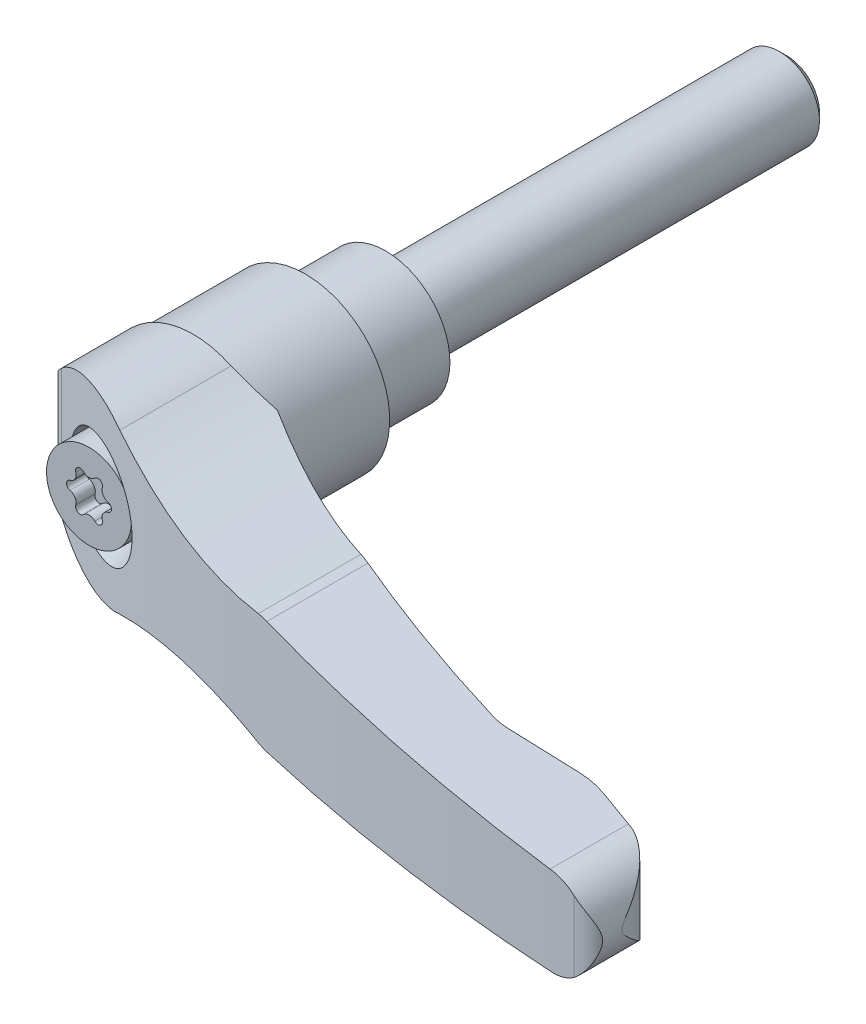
ISO-10303-21;
HEADER;
FILE_DESCRIPTION(('STEP AP214'),'2;1');
FILE_NAME('part.step','',(''),(''),'','','');
FILE_SCHEMA(('AUTOMOTIVE_DESIGN { 1 0 10303 214 1 1 1 1 }'));
ENDSEC;
DATA;
#1=APPLICATION_CONTEXT('core data for automotive mechanical design processes');
#2=APPLICATION_PROTOCOL_DEFINITION('international standard','automotive_design',2000,#1);
#3=PRODUCT_CONTEXT('',#1,'mechanical');
#4=PRODUCT('Part','Part','',(#3));
#5=PRODUCT_RELATED_PRODUCT_CATEGORY('part','',(#4));
#6=PRODUCT_DEFINITION_FORMATION('','',#4);
#7=PRODUCT_DEFINITION_CONTEXT('part definition',#1,'design');
#8=PRODUCT_DEFINITION('design','',#6,#7);
#9=PRODUCT_DEFINITION_SHAPE('','',#8);
#10=(LENGTH_UNIT() NAMED_UNIT(*) SI_UNIT(.MILLI.,.METRE.));
#11=(NAMED_UNIT(*) PLANE_ANGLE_UNIT() SI_UNIT($,.RADIAN.));
#12=(NAMED_UNIT(*) SI_UNIT($,.STERADIAN.) SOLID_ANGLE_UNIT());
#13=UNCERTAINTY_MEASURE_WITH_UNIT(LENGTH_MEASURE(1.E-05),#10,'distance_accuracy_value','');
#14=(GEOMETRIC_REPRESENTATION_CONTEXT(3) GLOBAL_UNCERTAINTY_ASSIGNED_CONTEXT((#13)) GLOBAL_UNIT_ASSIGNED_CONTEXT((#10,
#11,#12)) REPRESENTATION_CONTEXT('',''));
#15=CARTESIAN_POINT('',(0.,0.,0.));
#16=DIRECTION('',(0.,0.,1.));
#17=DIRECTION('',(1.,0.,0.));
#18=AXIS2_PLACEMENT_3D('',#15,#16,#17);
#19=CARTESIAN_POINT('',(0.,0.,-9.53924875));
#20=DIRECTION('',(0.,0.,-1.));
#21=DIRECTION('',(0.,1.,0.));
#22=AXIS2_PLACEMENT_3D('',#19,#20,#21);
#23=CYLINDRICAL_SURFACE('',#22,5.);
#24=CARTESIAN_POINT('',(0.,0.,-49.08));
#25=DIRECTION('',(0.,0.,-1.));
#26=DIRECTION('',(0.,1.,0.));
#27=AXIS2_PLACEMENT_3D('',#24,#25,#26);
#28=CIRCLE('',#27,5.);
#29=CARTESIAN_POINT('',(0.,5.,-49.08));
#30=VERTEX_POINT('',#29);
#31=EDGE_CURVE('E9',#30,#30,#28,.F.);
#32=ORIENTED_EDGE('',*,*,#31,.T.);
#33=EDGE_LOOP('',(#32));
#34=FACE_BOUND('',#33,.T.);
#35=CARTESIAN_POINT('',(0.,0.,0.));
#36=DIRECTION('',(0.,0.,-1.));
#37=DIRECTION('',(0.,1.,0.));
#38=AXIS2_PLACEMENT_3D('',#35,#36,#37);
#39=CIRCLE('',#38,5.);
#40=CARTESIAN_POINT('',(0.,5.,0.));
#41=VERTEX_POINT('',#40);
#42=EDGE_CURVE('E616',#41,#41,#39,.F.);
#43=ORIENTED_EDGE('',*,*,#42,.F.);
#44=EDGE_LOOP('',(#43));
#45=FACE_BOUND('',#44,.T.);
#46=ADVANCED_FACE('F14',(#34,#45),#23,.T.);
#47=CARTESIAN_POINT('',(6.5,0.,0.));
#48=DIRECTION('',(0.,0.,-1.));
#49=DIRECTION('',(0.,1.,0.));
#50=AXIS2_PLACEMENT_3D('',#47,#48,#49);
#51=PLANE('',#50);
#52=ORIENTED_EDGE('',*,*,#42,.T.);
#53=EDGE_LOOP('',(#52));
#54=FACE_BOUND('',#53,.T.);
#55=CARTESIAN_POINT('',(0.,0.,0.));
#56=DIRECTION('',(0.,0.,-1.));
#57=DIRECTION('',(0.,1.,0.));
#58=AXIS2_PLACEMENT_3D('',#55,#56,#57);
#59=CIRCLE('',#58,8.);
#60=CARTESIAN_POINT('',(0.,8.,0.));
#61=VERTEX_POINT('',#60);
#62=EDGE_CURVE('E699',#61,#61,#59,.F.);
#63=ORIENTED_EDGE('',*,*,#62,.F.);
#64=EDGE_LOOP('',(#63));
#65=FACE_BOUND('',#64,.T.);
#66=ADVANCED_FACE('F496',(#54,#65),#51,.T.);
#67=CARTESIAN_POINT('',(0.,0.,11.15));
#68=DIRECTION('',(0.,0.,-1.));
#69=DIRECTION('',(0.,1.,0.));
#70=AXIS2_PLACEMENT_3D('',#67,#68,#69);
#71=CYLINDRICAL_SURFACE('',#70,8.);
#72=ORIENTED_EDGE('',*,*,#62,.T.);
#73=EDGE_LOOP('',(#72));
#74=FACE_BOUND('',#73,.T.);
#75=CARTESIAN_POINT('',(0.,0.,10.7));
#76=DIRECTION('',(0.,0.,-1.));
#77=DIRECTION('',(1.,0.,0.));
#78=AXIS2_PLACEMENT_3D('',#75,#76,#77);
#79=CIRCLE('',#78,8.);
#80=CARTESIAN_POINT('',(8.,0.,10.7));
#81=VERTEX_POINT('',#80);
#82=EDGE_CURVE('E609',#81,#81,#79,.T.);
#83=ORIENTED_EDGE('',*,*,#82,.T.);
#84=EDGE_LOOP('',(#83));
#85=FACE_BOUND('',#84,.T.);
#86=ADVANCED_FACE('F487',(#74,#85),#71,.T.);
#87=CARTESIAN_POINT('',(0.,0.,10.4));
#88=DIRECTION('',(0.,0.,-1.));
#89=DIRECTION('',(0.,1.,0.));
#90=AXIS2_PLACEMENT_3D('',#87,#88,#89);
#91=CONICAL_SURFACE('',#90,8.3,0.785398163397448);
#92=ORIENTED_EDGE('',*,*,#82,.F.);
#93=EDGE_LOOP('',(#92));
#94=FACE_BOUND('',#93,.T.);
#95=CARTESIAN_POINT('',(0.,0.,10.4));
#96=DIRECTION('',(0.,0.,-1.));
#97=DIRECTION('',(0.,1.,0.));
#98=AXIS2_PLACEMENT_3D('',#95,#96,#97);
#99=CIRCLE('',#98,8.3);
#100=CARTESIAN_POINT('',(0.,8.3,10.4));
#101=VERTEX_POINT('',#100);
#102=EDGE_CURVE('E605',#101,#101,#99,.T.);
#103=ORIENTED_EDGE('',*,*,#102,.T.);
#104=EDGE_LOOP('',(#103));
#105=FACE_BOUND('',#104,.T.);
#106=ADVANCED_FACE('F483',(#94,#105),#91,.F.);
#107=CARTESIAN_POINT('',(0.,0.,9.7));
#108=DIRECTION('',(0.,0.,-1.));
#109=DIRECTION('',(0.,1.,0.));
#110=AXIS2_PLACEMENT_3D('',#107,#108,#109);
#111=CYLINDRICAL_SURFACE('',#110,8.3);
#112=ORIENTED_EDGE('',*,*,#102,.F.);
#113=EDGE_LOOP('',(#112));
#114=FACE_BOUND('',#113,.T.);
#115=CARTESIAN_POINT('',(0.,0.,10.));
#116=DIRECTION('',(0.,0.,-1.));
#117=DIRECTION('',(0.,1.,0.));
#118=AXIS2_PLACEMENT_3D('',#115,#116,#117);
#119=CIRCLE('',#118,8.3);
#120=CARTESIAN_POINT('',(0.,8.3,10.));
#121=VERTEX_POINT('',#120);
#122=EDGE_CURVE('E608',#121,#121,#119,.F.);
#123=ORIENTED_EDGE('',*,*,#122,.F.);
#124=EDGE_LOOP('',(#123));
#125=FACE_BOUND('',#124,.T.);
#126=ADVANCED_FACE('F479',(#114,#125),#111,.F.);
#127=CARTESIAN_POINT('',(-5.26,0.,10.));
#128=DIRECTION('',(0.,0.,-1.));
#129=DIRECTION('',(0.,1.,0.));
#130=AXIS2_PLACEMENT_3D('',#127,#128,#129);
#131=PLANE('',#130);
#132=CARTESIAN_POINT('',(-0.00999999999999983,0.,10.));
#133=DIRECTION('',(0.,0.,1.));
#134=DIRECTION('',(-1.,0.,0.));
#135=AXIS2_PLACEMENT_3D('',#132,#133,#134);
#136=CIRCLE('',#135,10.5);
#137=CARTESIAN_POINT('',(-10.2600377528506,-2.27743848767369,10.));
#138=VERTEX_POINT('',#137);
#139=CARTESIAN_POINT('',(-10.2600377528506,2.27743848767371,10.));
#140=VERTEX_POINT('',#139);
#141=EDGE_CURVE('E707',#138,#140,#136,.T.);
#142=ORIENTED_EDGE('',*,*,#141,.F.);
#143=DIRECTION('',(0.,-1.,0.));
#144=VECTOR('',#143,1.);
#145=CARTESIAN_POINT('',(-10.2600377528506,-22.,10.));
#146=LINE('',#145,#144);
#147=EDGE_CURVE('E706',#138,#140,#146,.F.);
#148=ORIENTED_EDGE('',*,*,#147,.T.);
#149=EDGE_LOOP('',(#142,#148));
#150=FACE_BOUND('',#149,.T.);
#151=ORIENTED_EDGE('',*,*,#122,.T.);
#152=EDGE_LOOP('',(#151));
#153=FACE_BOUND('',#152,.T.);
#154=ADVANCED_FACE('F475',(#150,#153),#131,.T.);
#155=CARTESIAN_POINT('',(-10.2600377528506,-22.,10.));
#156=DIRECTION('',(0.707106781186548,0.,0.707106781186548));
#157=DIRECTION('',(-0.707106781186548,0.,0.707106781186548));
#158=AXIS2_PLACEMENT_3D('',#155,#156,#157);
#159=PLANE('',#158);
#160=ORIENTED_EDGE('',*,*,#147,.F.);
#161=CARTESIAN_POINT('',(-0.00999999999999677,0.,-0.250037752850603));
#162=DIRECTION('',(0.707106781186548,0.,0.707106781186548));
#163=DIRECTION('',(-0.707106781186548,0.,0.707106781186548));
#164=AXIS2_PLACEMENT_3D('',#161,#162,#163);
#165=ELLIPSE('',#164,14.8492424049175,10.5);
#166=EDGE_CURVE('E709',#140,#138,#165,.T.);
#167=ORIENTED_EDGE('',*,*,#166,.F.);
#168=EDGE_LOOP('',(#160,#167));
#169=FACE_BOUND('',#168,.T.);
#170=ADVANCED_FACE('F471',(#169),#159,.F.);
#171=CARTESIAN_POINT('',(-0.0100000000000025,0.,18.90625));
#172=DIRECTION('',(0.,0.,1.));
#173=DIRECTION('',(-1.,0.,0.));
#174=AXIS2_PLACEMENT_3D('',#171,#172,#173);
#175=CYLINDRICAL_SURFACE('',#174,10.5);
#176=CARTESIAN_POINT('',(-0.010000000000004,0.,24.));
#177=DIRECTION('',(0.,0.,1.));
#178=DIRECTION('',(-1.,0.,0.));
#179=AXIS2_PLACEMENT_3D('',#176,#177,#178);
#180=CIRCLE('',#179,10.5);
#181=CARTESIAN_POINT('',(-10.51,0.,24.));
#182=VERTEX_POINT('',#181);
#183=CARTESIAN_POINT('',(10.49,0.,24.));
#184=VERTEX_POINT('',#183);
#185=EDGE_CURVE('E456',#182,#184,#180,.T.);
#186=ORIENTED_EDGE('',*,*,#185,.F.);
#187=CARTESIAN_POINT('',(-0.010000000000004,0.,24.));
#188=DIRECTION('',(0.,0.,1.));
#189=DIRECTION('',(-1.,0.,0.));
#190=AXIS2_PLACEMENT_3D('',#187,#188,#189);
#191=CIRCLE('',#190,10.5);
#192=EDGE_CURVE('E591',#184,#182,#191,.T.);
#193=ORIENTED_EDGE('',*,*,#192,.F.);
#194=EDGE_LOOP('',(#186,#193));
#195=FACE_BOUND('',#194,.T.);
#196=ORIENTED_EDGE('',*,*,#141,.T.);
#197=ORIENTED_EDGE('',*,*,#166,.T.);
#198=EDGE_LOOP('',(#196,#197));
#199=FACE_BOUND('',#198,.T.);
#200=ADVANCED_FACE('F467',(#195,#199),#175,.T.);
#201=CARTESIAN_POINT('',(-10.51,-12.,24.));
#202=DIRECTION('',(0.,0.,-1.));
#203=DIRECTION('',(0.,1.,0.));
#204=AXIS2_PLACEMENT_3D('',#201,#202,#203);
#205=PLANE('',#204);
#206=ORIENTED_EDGE('',*,*,#185,.T.);
#207=DIRECTION('',(0.,-1.,0.));
#208=VECTOR('',#207,1.);
#209=CARTESIAN_POINT('',(10.4900000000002,-12.,23.9999999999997));
#210=LINE('',#209,#208);
#211=CARTESIAN_POINT('',(10.4900000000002,-8.03465812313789,24.));
#212=VERTEX_POINT('',#211);
#213=EDGE_CURVE('E442',#184,#212,#210,.T.);
#214=ORIENTED_EDGE('',*,*,#213,.T.);
#215=CARTESIAN_POINT('',(22.94,-55.53,24.));
#216=DIRECTION('',(0.,0.,1.));
#217=DIRECTION('',(0.,-1.,0.));
#218=AXIS2_PLACEMENT_3D('',#215,#216,#217);
#219=CIRCLE('',#218,49.1);
#220=CARTESIAN_POINT('',(4.72251026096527,-9.93468151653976,24.));
#221=VERTEX_POINT('',#220);
#222=EDGE_CURVE('E746',#212,#221,#219,.T.);
#223=ORIENTED_EDGE('',*,*,#222,.T.);
#224=CARTESIAN_POINT('',(0.,0.,24.));
#225=DIRECTION('',(0.,0.,1.));
#226=DIRECTION('',(0.,-1.,0.));
#227=AXIS2_PLACEMENT_3D('',#224,#225,#226);
#228=CIRCLE('',#227,11.);
#229=CARTESIAN_POINT('',(-10.51,-3.24652121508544,24.));
#230=VERTEX_POINT('',#229);
#231=EDGE_CURVE('E740',#230,#221,#228,.T.);
#232=ORIENTED_EDGE('',*,*,#231,.F.);
#233=DIRECTION('',(0.,-1.,0.));
#234=VECTOR('',#233,1.);
#235=CARTESIAN_POINT('',(-10.51,-12.,24.));
#236=LINE('',#235,#234);
#237=EDGE_CURVE('E590',#182,#230,#236,.T.);
#238=ORIENTED_EDGE('',*,*,#237,.F.);
#239=EDGE_LOOP('',(#206,#214,#223,#232,#238));
#240=FACE_BOUND('',#239,.T.);
#241=ADVANCED_FACE('F462',(#240),#205,.T.);
#242=CARTESIAN_POINT('',(31.3589689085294,0.945932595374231,54.5));
#243=DIRECTION('',(0.,0.,1.));
#244=DIRECTION('',(0.,-1.,0.));
#245=AXIS2_PLACEMENT_3D('',#242,#243,#244);
#246=CYLINDRICAL_SURFACE('',#245,8.00000000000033);
#247=CARTESIAN_POINT('',(31.6479325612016,-7.04884695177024,46.4731806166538));
#248=CARTESIAN_POINT('',(31.4018180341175,-7.05768532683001,46.4087993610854));
#249=CARTESIAN_POINT('',(31.1563854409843,-7.05525330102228,46.3442255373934));
#250=CARTESIAN_POINT('',(30.66688412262,-7.02784844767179,46.2146927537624));
#251=CARTESIAN_POINT('',(30.4228153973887,-7.00287562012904,46.1497337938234));
#252=CARTESIAN_POINT('',(30.1794286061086,-6.96663239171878,46.0845822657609));
#253=B_SPLINE_CURVE_WITH_KNOTS('',3,(#247,#248,#249,#250,#251,#252),.UNSPECIFIED.,.F.,.F.,(4,2,
4),(0.,0.76139061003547,1.52278122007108),.UNSPECIFIED.);
#254=CARTESIAN_POINT('',(31.6479325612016,-7.04884695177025,46.4731806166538));
#255=VERTEX_POINT('',#254);
#256=CARTESIAN_POINT('',(30.1794286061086,-6.96663239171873,46.084582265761));
#257=VERTEX_POINT('',#256);
#258=EDGE_CURVE('E449',#255,#257,#253,.T.);
#259=ORIENTED_EDGE('',*,*,#258,.T.);
#260=DIRECTION('',(0.,0.,1.));
#261=VECTOR('',#260,1.);
#262=CARTESIAN_POINT('',(30.1794286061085,-6.96663239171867,54.5));
#263=LINE('',#262,#261);
#264=CARTESIAN_POINT('',(30.1794286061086,-6.96663239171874,33.2732494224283));
#265=VERTEX_POINT('',#264);
#266=EDGE_CURVE('E741',#257,#265,#263,.F.);
#267=ORIENTED_EDGE('',*,*,#266,.T.);
#268=CARTESIAN_POINT('',(30.1794286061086,-6.9666323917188,33.2732494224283));
#269=CARTESIAN_POINT('',(30.4222007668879,-7.00282816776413,33.3728739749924));
#270=CARTESIAN_POINT('',(30.6665043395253,-7.02781937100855,33.4725985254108));
#271=CARTESIAN_POINT('',(31.0339219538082,-7.04840105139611,33.6217860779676));
#272=CARTESIAN_POINT('',(31.1565128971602,-7.05244559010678,33.6714318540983));
#273=CARTESIAN_POINT('',(31.4020580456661,-7.05489552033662,33.7706062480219));
#274=CARTESIAN_POINT('',(31.5250125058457,-7.05329063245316,33.8201344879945));
#275=CARTESIAN_POINT('',(31.6479325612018,-7.04884695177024,33.8695155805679));
#276=B_SPLINE_CURVE_WITH_KNOTS('',3,(#268,#269,#270,#271,#272,#273,#274,#275),.UNSPECIFIED.,.F.,
.F.,(4,2,2,4),(0.,0.794258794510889,1.19111760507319,1.58869889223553),.UNSPECIFIED.);
#277=CARTESIAN_POINT('',(31.6479325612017,-7.04884695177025,33.8695155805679));
#278=VERTEX_POINT('',#277);
#279=EDGE_CURVE('E444',#265,#278,#276,.T.);
#280=ORIENTED_EDGE('',*,*,#279,.T.);
#281=DIRECTION('',(0.,0.,1.));
#282=VECTOR('',#281,1.);
#283=CARTESIAN_POINT('',(31.6479325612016,-7.04884695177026,54.5));
#284=LINE('',#283,#282);
#285=EDGE_CURVE('E751',#278,#255,#284,.T.);
#286=ORIENTED_EDGE('',*,*,#285,.T.);
#287=EDGE_LOOP('',(#259,#267,#280,#286));
#288=FACE_BOUND('',#287,.T.);
#289=ADVANCED_FACE('F458',(#288),#246,.T.);
#290=CARTESIAN_POINT('',(79.9967051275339,-12.,50.5395921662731));
#291=DIRECTION('',(0.992331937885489,0.,-0.123601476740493));
#292=DIRECTION('',(0.123601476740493,0.,0.992331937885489));
#293=AXIS2_PLACEMENT_3D('',#290,#291,#292);
#294=PLANE('',#293);
#295=CARTESIAN_POINT('',(79.9967051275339,-0.190348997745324,50.5395921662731));
#296=CARTESIAN_POINT('',(79.9969785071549,-0.182455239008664,50.5417867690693));
#297=CARTESIAN_POINT('',(79.9972360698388,-0.174525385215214,50.543854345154));
#298=CARTESIAN_POINT('',(79.9977166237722,-0.158664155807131,50.5477118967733));
#299=CARTESIAN_POINT('',(79.9979398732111,-0.150733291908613,50.5495039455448));
#300=CARTESIAN_POINT('',(79.9983518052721,-0.134870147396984,50.5528105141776));
#301=CARTESIAN_POINT('',(79.998540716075,-0.12693825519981,50.5543268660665));
#302=CARTESIAN_POINT('',(79.9988840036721,-0.111073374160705,50.5570823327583));
#303=CARTESIAN_POINT('',(79.9990385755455,-0.103140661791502,50.5583230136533));
#304=CARTESIAN_POINT('',(79.9993132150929,-0.087274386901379,50.5605274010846));
#305=CARTESIAN_POINT('',(79.9994334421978,-0.0793410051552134,50.5614923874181));
#306=CARTESIAN_POINT('',(79.9996394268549,-0.0634736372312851,50.5631456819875));
#307=CARTESIAN_POINT('',(79.9997253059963,-0.0555397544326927,50.5638349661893));
#308=CARTESIAN_POINT('',(79.9998626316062,-0.0396716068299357,50.5649371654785));
#309=CARTESIAN_POINT('',(79.9999141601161,-0.0317373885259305,50.5653507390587));
#310=CARTESIAN_POINT('',(79.9999828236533,-0.0158687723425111,50.5659018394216));
#311=CARTESIAN_POINT('',(80.,-0.00793438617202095,50.5660396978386));
#312=CARTESIAN_POINT('',(80.,0.00793438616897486,50.5660396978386));
#313=CARTESIAN_POINT('',(79.9999828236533,0.0158687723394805,50.5659018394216));
#314=CARTESIAN_POINT('',(79.9999141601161,0.0317373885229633,50.5653507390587));
#315=CARTESIAN_POINT('',(79.9998626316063,0.0396716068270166,50.5649371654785));
#316=CARTESIAN_POINT('',(79.9997253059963,0.0555397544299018,50.5638349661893));
#317=CARTESIAN_POINT('',(79.9996394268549,0.0634736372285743,50.5631456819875));
#318=CARTESIAN_POINT('',(79.9994334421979,0.0793410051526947,50.5614923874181));
#319=CARTESIAN_POINT('',(79.9993132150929,0.0872743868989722,50.5605274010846));
#320=CARTESIAN_POINT('',(79.9990385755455,0.103140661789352,50.5583230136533));
#321=CARTESIAN_POINT('',(79.9988840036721,0.111073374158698,50.5570823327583));
#322=CARTESIAN_POINT('',(79.998540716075,0.126938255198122,50.5543268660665));
#323=CARTESIAN_POINT('',(79.9983518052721,0.134870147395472,50.5528105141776));
#324=CARTESIAN_POINT('',(79.9979398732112,0.150733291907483,50.5495039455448));
#325=CARTESIAN_POINT('',(79.9977166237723,0.158664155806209,50.5477118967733));
#326=CARTESIAN_POINT('',(79.9972360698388,0.174525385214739,50.543854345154));
#327=CARTESIAN_POINT('',(79.9969785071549,0.182455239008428,50.5417867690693));
#328=CARTESIAN_POINT('',(79.9967051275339,0.190348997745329,50.5395921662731));
#329=B_SPLINE_CURVE_WITH_KNOTS('',3,(#295,#296,#297,#298,#299,#300,#301,#302,#303,#304,#305,
#306,#307,#308,#309,#310,#311,#312,#313,#314,#315,#316,#317,#318,#319,#320,#321,#322,#323,#324,
#325,#326,#327,#328),.UNSPECIFIED.,.F.,.F.,(4,2,2,2,2,2,2,2,2,2,2,2,2,2,2,2,4),(0.,
0.0245923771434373,0.0489895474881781,0.0732181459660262,0.0973053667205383,0.121278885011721,
0.145166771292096,0.168997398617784,0.19279934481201,0.216601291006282,0.240431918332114,
0.264319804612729,0.288293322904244,0.312380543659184,0.336609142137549,0.361006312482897,
0.385598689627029),.UNSPECIFIED.);
#330=CARTESIAN_POINT('',(79.9967051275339,-0.190348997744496,50.5395921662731));
#331=VERTEX_POINT('',#330);
#332=CARTESIAN_POINT('',(79.9967051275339,0.190348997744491,50.5395921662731));
#333=VERTEX_POINT('',#332);
#334=EDGE_CURVE('E370',#331,#333,#329,.T.);
#335=ORIENTED_EDGE('',*,*,#334,.F.);
#336=DIRECTION('',(0.,-1.,0.));
#337=VECTOR('',#336,1.);
#338=CARTESIAN_POINT('',(79.9967051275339,-12.,50.5395921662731));
#339=LINE('',#338,#337);
#340=EDGE_CURVE('E455',#333,#331,#339,.T.);
#341=ORIENTED_EDGE('',*,*,#340,.F.);
#342=EDGE_LOOP('',(#335,#341));
#343=FACE_BOUND('',#342,.T.);
#344=ADVANCED_FACE('F399',(#343),#294,.T.);
#345=CARTESIAN_POINT('',(72.6137555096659,-12.,51.4591871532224));
#346=DIRECTION('',(0.,-1.,0.));
#347=DIRECTION('',(1.,0.,0.));
#348=AXIS2_PLACEMENT_3D('',#345,#346,#347);
#349=CYLINDRICAL_SURFACE('',#348,7.44);
#350=CARTESIAN_POINT('',(79.9967051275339,0.190348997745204,50.5395921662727));
#351=CARTESIAN_POINT('',(79.9951469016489,0.235214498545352,50.5270575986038));
#352=CARTESIAN_POINT('',(79.9930953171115,0.27873685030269,50.5108629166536));
#353=CARTESIAN_POINT('',(79.988164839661,0.363077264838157,50.4732708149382));
#354=CARTESIAN_POINT('',(79.9852922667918,0.40391316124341,50.4519133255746));
#355=CARTESIAN_POINT('',(79.975702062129,0.52245816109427,50.3833482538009));
#356=CARTESIAN_POINT('',(79.9679715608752,0.597169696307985,50.3312876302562));
#357=CARTESIAN_POINT('',(79.9508869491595,0.736456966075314,50.2251559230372));
#358=CARTESIAN_POINT('',(79.9416856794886,0.801375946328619,50.1714851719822));
#359=CARTESIAN_POINT('',(79.9214540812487,0.928420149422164,50.0612288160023));
#360=CARTESIAN_POINT('',(79.9104232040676,0.990544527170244,50.0046423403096));
#361=CARTESIAN_POINT('',(79.8746515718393,1.17419942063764,49.8323129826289));
#362=CARTESIAN_POINT('',(79.8472488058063,1.29287988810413,49.7141099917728));
#363=CARTESIAN_POINT('',(79.7848398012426,1.52823594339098,49.4729704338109));
#364=CARTESIAN_POINT('',(79.7496926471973,1.64482416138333,49.3499864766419));
#365=CARTESIAN_POINT('',(79.6721004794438,1.87458318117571,49.1033284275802));
#366=CARTESIAN_POINT('',(79.6296610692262,1.98775652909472,48.9796549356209));
#367=CARTESIAN_POINT('',(79.5033816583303,2.29352791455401,48.6415502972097));
#368=CARTESIAN_POINT('',(79.4120558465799,2.48329449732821,48.427296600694));
#369=CARTESIAN_POINT('',(79.2061355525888,2.85434488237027,48.0023120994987));
#370=CARTESIAN_POINT('',(79.0915236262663,3.03562219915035,47.7915840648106));
#371=CARTESIAN_POINT('',(78.8390032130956,3.38665877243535,47.3777391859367));
#372=CARTESIAN_POINT('',(78.7012752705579,3.5564939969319,47.1745772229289));
#373=CARTESIAN_POINT('',(78.4009143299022,3.88356808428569,46.7768350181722));
#374=CARTESIAN_POINT('',(78.2383021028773,4.04081728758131,46.5822477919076));
#375=CARTESIAN_POINT('',(77.9568022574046,4.2801698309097,46.2794503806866));
#376=CARTESIAN_POINT('',(77.8461272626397,4.36735584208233,46.1675710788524));
#377=CARTESIAN_POINT('',(77.61512986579,4.53501217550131,45.9487274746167));
#378=CARTESIAN_POINT('',(77.494805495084,4.61548112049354,45.8417641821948));
#379=CARTESIAN_POINT('',(77.2447591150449,4.7684092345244,45.6339165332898));
#380=CARTESIAN_POINT('',(77.1150589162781,4.84088606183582,45.5330190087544));
#381=CARTESIAN_POINT('',(76.8461728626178,4.97676025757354,45.3380932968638));
#382=CARTESIAN_POINT('',(76.7069926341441,5.04016294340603,45.2440611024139));
#383=CARTESIAN_POINT('',(76.4438690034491,5.14664435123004,45.0792448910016));
#384=CARTESIAN_POINT('',(76.3213555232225,5.19134589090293,45.0072256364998));
#385=CARTESIAN_POINT('',(76.0703754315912,5.27269544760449,44.8693561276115));
#386=CARTESIAN_POINT('',(75.9419112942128,5.30934677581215,44.8035033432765));
#387=CARTESIAN_POINT('',(75.678496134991,5.37397975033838,44.6781572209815));
#388=CARTESIAN_POINT('',(75.5435027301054,5.40189236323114,44.6187168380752));
#389=CARTESIAN_POINT('',(75.2686009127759,5.44782102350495,44.507386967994));
#390=CARTESIAN_POINT('',(75.1286862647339,5.46582399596,44.4555075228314));
#391=CARTESIAN_POINT('',(74.9868127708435,5.47841339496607,44.407790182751));
#392=B_SPLINE_CURVE_WITH_KNOTS('',3,(#350,#351,#352,#353,#354,#355,#356,#357,#358,#359,#360,
#361,#362,#363,#364,#365,#366,#367,#368,#369,#370,#371,#372,#373,#374,#375,#376,#377,#378,#379,
#380,#381,#382,#383,#384,#385,#386,#387,#388,#389,#390,#391),.UNSPECIFIED.,.F.,.F.,(4,2,2,2,2,2,
2,2,2,2,2,2,2,2,2,2,2,2,2,2,4),(0.,0.139245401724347,0.277446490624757,0.550810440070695,
0.804906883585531,1.05907965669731,1.56794086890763,2.08696422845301,2.60559053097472,
3.50582150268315,4.40672935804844,5.30090298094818,6.1943342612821,6.73367946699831,
7.27313498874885,7.81137365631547,8.3492956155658,8.79580649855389,9.24213337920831,
9.69190199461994,10.1422626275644),.UNSPECIFIED.);
#393=CARTESIAN_POINT('',(74.9868127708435,5.47841339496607,44.407790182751));
#394=VERTEX_POINT('',#393);
#395=EDGE_CURVE('E387',#333,#394,#392,.T.);
#396=ORIENTED_EDGE('',*,*,#395,.F.);
#397=ORIENTED_EDGE('',*,*,#340,.T.);
#398=CARTESIAN_POINT('',(74.9868127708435,-5.47841339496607,44.407790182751));
#399=CARTESIAN_POINT('',(75.1398120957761,-5.46484028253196,44.459242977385));
#400=CARTESIAN_POINT('',(75.2905169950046,-5.44496899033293,44.5155387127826));
#401=CARTESIAN_POINT('',(75.5860882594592,-5.39377415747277,44.6368581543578));
#402=CARTESIAN_POINT('',(75.7309637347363,-5.36246932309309,44.7018674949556));
#403=CARTESIAN_POINT('',(76.0125967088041,-5.28989557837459,44.8390817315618));
#404=CARTESIAN_POINT('',(76.1494251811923,-5.24873835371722,44.9112009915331));
#405=CARTESIAN_POINT('',(76.4161065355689,-5.15736483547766,45.0623731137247));
#406=CARTESIAN_POINT('',(76.5459558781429,-5.10714400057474,45.1414294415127));
#407=CARTESIAN_POINT('',(76.8276536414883,-4.98604991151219,45.3247681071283));
#408=CARTESIAN_POINT('',(76.9775772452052,-4.91309116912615,45.4306358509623));
#409=CARTESIAN_POINT('',(77.265789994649,-4.75681575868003,45.6501400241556));
#410=CARTESIAN_POINT('',(77.4040776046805,-4.67349772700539,45.7637774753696));
#411=CARTESIAN_POINT('',(77.8028296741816,-4.40945601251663,46.1156758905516));
#412=CARTESIAN_POINT('',(78.0457801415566,-4.21527563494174,46.3639882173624));
#413=CARTESIAN_POINT('',(78.417694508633,-3.86589184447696,46.7984433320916));
#414=CARTESIAN_POINT('',(78.5586476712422,-3.71726415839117,46.9799982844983));
#415=CARTESIAN_POINT('',(78.8199419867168,-3.41009407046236,47.3496806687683));
#416=CARTESIAN_POINT('',(78.940273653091,-3.25154715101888,47.537811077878));
#417=CARTESIAN_POINT('',(79.1607378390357,-2.92676895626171,47.9181651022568));
#418=CARTESIAN_POINT('',(79.2609186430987,-2.76055725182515,48.1103776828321));
#419=CARTESIAN_POINT('',(79.4421677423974,-2.42115236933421,48.4974286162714));
#420=CARTESIAN_POINT('',(79.5232445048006,-2.24796232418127,48.692265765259));
#421=CARTESIAN_POINT('',(79.6578968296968,-1.91676087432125,49.0578102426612));
#422=CARTESIAN_POINT('',(79.7136489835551,-1.75958096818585,49.2284695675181));
#423=CARTESIAN_POINT('',(79.786963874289,-1.51825146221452,49.4826945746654));
#424=CARTESIAN_POINT('',(79.8097141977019,-1.43673320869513,49.567289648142));
#425=CARTESIAN_POINT('',(79.8517302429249,-1.27132927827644,49.7350141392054));
#426=CARTESIAN_POINT('',(79.870996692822,-1.18744410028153,49.8181438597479));
#427=CARTESIAN_POINT('',(79.9071865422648,-1.01046435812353,49.9869732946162));
#428=CARTESIAN_POINT('',(79.9238666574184,-0.917129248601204,50.0724723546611));
#429=CARTESIAN_POINT('',(79.9529450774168,-0.724505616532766,50.2358460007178));
#430=CARTESIAN_POINT('',(79.9653823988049,-0.625281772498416,50.3137850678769));
#431=CARTESIAN_POINT('',(79.9802376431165,-0.468580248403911,50.4153149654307));
#432=CARTESIAN_POINT('',(79.9845030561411,-0.416215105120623,50.4460963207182));
#433=CARTESIAN_POINT('',(79.9917045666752,-0.30687937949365,50.4998809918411));
#434=CARTESIAN_POINT('',(79.9946243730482,-0.249861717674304,50.5227881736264));
#435=CARTESIAN_POINT('',(79.9967051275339,-0.190348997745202,50.5395921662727));
#436=B_SPLINE_CURVE_WITH_KNOTS('',3,(#398,#399,#400,#401,#402,#403,#404,#405,#406,#407,#408,
#409,#410,#411,#412,#413,#414,#415,#416,#417,#418,#419,#420,#421,#422,#423,#424,#425,#426,#427,
#428,#429,#430,#431,#432,#433,#434,#435),.UNSPECIFIED.,.F.,.F.,(4,2,2,2,2,2,2,2,2,2,2,2,2,2,2,2,
2,2,4),(0.,0.485611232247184,0.970431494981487,1.44999646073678,1.92980238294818,
2.52141817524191,3.11311192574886,4.30183389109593,5.12208341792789,5.94270927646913,
6.76134473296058,7.57961667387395,8.29494630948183,8.65387747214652,9.01273353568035,
9.39561932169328,9.77488268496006,9.95698827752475,10.141244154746),.UNSPECIFIED.);
#437=CARTESIAN_POINT('',(74.9868127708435,-5.47841339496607,44.407790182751));
#438=VERTEX_POINT('',#437);
#439=EDGE_CURVE('E359',#438,#331,#436,.T.);
#440=ORIENTED_EDGE('',*,*,#439,.F.);
#441=DIRECTION('',(0.,-1.,0.));
#442=VECTOR('',#441,1.);
#443=CARTESIAN_POINT('',(74.9868127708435,-12.,44.407790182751));
#444=LINE('',#443,#442);
#445=EDGE_CURVE('E443',#394,#438,#444,.T.);
#446=ORIENTED_EDGE('',*,*,#445,.F.);
#447=EDGE_LOOP('',(#396,#397,#440,#446));
#448=FACE_BOUND('',#447,.T.);
#449=ADVANCED_FACE('F393',(#448),#349,.T.);
#450=CARTESIAN_POINT('',(57.3760512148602,-12.,33.47));
#451=DIRECTION('',(0.,-1.,0.));
#452=DIRECTION('',(1.,0.,0.));
#453=AXIS2_PLACEMENT_3D('',#450,#451,#452);
#454=CYLINDRICAL_SURFACE('',#453,8.58999999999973);
#455=DIRECTION('',(0.,-1.,0.));
#456=VECTOR('',#455,1.);
#457=CARTESIAN_POINT('',(55.1138126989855,-12.,41.756759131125));
#458=LINE('',#457,#456);
#459=CARTESIAN_POINT('',(55.1138126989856,-6.20069518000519,41.7567591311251));
#460=VERTEX_POINT('',#459);
#461=CARTESIAN_POINT('',(55.1138126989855,6.2006951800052,41.7567591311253));
#462=VERTEX_POINT('',#461);
#463=EDGE_CURVE('E735',#460,#462,#458,.F.);
#464=ORIENTED_EDGE('',*,*,#463,.T.);
#465=CARTESIAN_POINT('',(57.3760512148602,6.11892873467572,33.47));
#466=DIRECTION('',(-0.0361204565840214,-0.999347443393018,0.));
#467=DIRECTION('',(0.999347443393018,-0.0361204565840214,0.));
#468=AXIS2_PLACEMENT_3D('',#465,#466,#467);
#469=ELLIPSE('',#468,8.59560912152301,8.58999999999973);
#470=CARTESIAN_POINT('',(57.3760512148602,6.11892873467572,42.06));
#471=VERTEX_POINT('',#470);
#472=EDGE_CURVE('E816',#462,#471,#469,.F.);
#473=ORIENTED_EDGE('',*,*,#472,.T.);
#474=DIRECTION('',(0.,1.,0.));
#475=VECTOR('',#474,1.);
#476=CARTESIAN_POINT('',(57.3760512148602,-12.,42.06));
#477=LINE('',#476,#475);
#478=CARTESIAN_POINT('',(57.3760512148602,-6.11892873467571,42.06));
#479=VERTEX_POINT('',#478);
#480=EDGE_CURVE('E596',#479,#471,#477,.T.);
#481=ORIENTED_EDGE('',*,*,#480,.F.);
#482=CARTESIAN_POINT('',(57.3760512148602,-6.11892873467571,33.47));
#483=DIRECTION('',(-0.0361204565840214,0.999347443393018,0.));
#484=DIRECTION('',(-0.999347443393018,-0.0361204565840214,0.));
#485=AXIS2_PLACEMENT_3D('',#482,#483,#484);
#486=ELLIPSE('',#485,8.59560912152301,8.58999999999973);
#487=EDGE_CURVE('E756',#479,#460,#486,.F.);
#488=ORIENTED_EDGE('',*,*,#487,.T.);
#489=EDGE_LOOP('',(#464,#473,#481,#488));
#490=FACE_BOUND('',#489,.T.);
#491=ADVANCED_FACE('F398',(#490),#454,.F.);
#492=CARTESIAN_POINT('',(57.3760512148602,-12.,42.06));
#493=DIRECTION('',(0.,0.,-1.));
#494=DIRECTION('',(0.,1.,0.));
#495=AXIS2_PLACEMENT_3D('',#492,#493,#494);
#496=PLANE('',#495);
#497=DIRECTION('',(0.999347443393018,-0.0361204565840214,0.));
#498=VECTOR('',#497,1.);
#499=CARTESIAN_POINT('',(31.6479325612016,7.04884695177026,42.06));
#500=LINE('',#499,#498);
#501=CARTESIAN_POINT('',(66.1633245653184,5.80132115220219,42.06));
#502=VERTEX_POINT('',#501);
#503=EDGE_CURVE('E813',#471,#502,#500,.T.);
#504=ORIENTED_EDGE('',*,*,#503,.T.);
#505=DIRECTION('',(0.,-1.,0.));
#506=VECTOR('',#505,1.);
#507=CARTESIAN_POINT('',(66.1633245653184,-12.,42.06));
#508=LINE('',#507,#506);
#509=CARTESIAN_POINT('',(66.1633245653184,-5.80132115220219,42.06));
#510=VERTEX_POINT('',#509);
#511=EDGE_CURVE('E595',#510,#502,#508,.F.);
#512=ORIENTED_EDGE('',*,*,#511,.F.);
#513=DIRECTION('',(-0.999347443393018,-0.0361204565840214,0.));
#514=VECTOR('',#513,1.);
#515=CARTESIAN_POINT('',(74.5,-5.5,42.06));
#516=LINE('',#515,#514);
#517=EDGE_CURVE('E754',#510,#479,#516,.T.);
#518=ORIENTED_EDGE('',*,*,#517,.T.);
#519=ORIENTED_EDGE('',*,*,#480,.T.);
#520=EDGE_LOOP('',(#504,#512,#518,#519));
#521=FACE_BOUND('',#520,.T.);
#522=ADVANCED_FACE('F405',(#521),#496,.T.);
#523=CARTESIAN_POINT('',(66.1633245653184,-12.,53.34));
#524=DIRECTION('',(0.,-1.,0.));
#525=DIRECTION('',(1.,0.,0.));
#526=AXIS2_PLACEMENT_3D('',#523,#524,#525);
#527=CYLINDRICAL_SURFACE('',#526,11.2800000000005);
#528=CARTESIAN_POINT('',(66.1633245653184,5.80132115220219,53.34));
#529=DIRECTION('',(-0.0361204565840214,-0.999347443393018,0.));
#530=DIRECTION('',(0.999347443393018,-0.0361204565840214,0.));
#531=AXIS2_PLACEMENT_3D('',#528,#529,#530);
#532=ELLIPSE('',#531,11.2873656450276,11.2800000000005);
#533=CARTESIAN_POINT('',(69.7611855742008,5.6712799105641,42.6491723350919));
#534=VERTEX_POINT('',#533);
#535=EDGE_CURVE('E815',#502,#534,#532,.T.);
#536=ORIENTED_EDGE('',*,*,#535,.T.);
#537=DIRECTION('',(0.,-1.,0.));
#538=VECTOR('',#537,1.);
#539=CARTESIAN_POINT('',(69.7611855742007,-12.,42.6491723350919));
#540=LINE('',#539,#538);
#541=CARTESIAN_POINT('',(69.7611855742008,-5.6712799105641,42.6491723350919));
#542=VERTEX_POINT('',#541);
#543=EDGE_CURVE('E592',#542,#534,#540,.F.);
#544=ORIENTED_EDGE('',*,*,#543,.F.);
#545=CARTESIAN_POINT('',(66.1633245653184,-5.80132115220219,53.34));
#546=DIRECTION('',(-0.0361204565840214,0.999347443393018,0.));
#547=DIRECTION('',(-0.999347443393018,-0.0361204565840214,0.));
#548=AXIS2_PLACEMENT_3D('',#545,#546,#547);
#549=ELLIPSE('',#548,11.2873656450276,11.2800000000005);
#550=EDGE_CURVE('E757',#542,#510,#549,.T.);
#551=ORIENTED_EDGE('',*,*,#550,.T.);
#552=ORIENTED_EDGE('',*,*,#511,.T.);
#553=EDGE_LOOP('',(#536,#544,#551,#552));
#554=FACE_BOUND('',#553,.T.);
#555=ADVANCED_FACE('F409',(#554),#527,.T.);
#556=CARTESIAN_POINT('',(69.7611855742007,-12.,42.6491723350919));
#557=DIRECTION('',(0.318959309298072,0.,-0.947768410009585));
#558=DIRECTION('',(0.947768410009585,0.,0.318959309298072));
#559=AXIS2_PLACEMENT_3D('',#556,#557,#558);
#560=PLANE('',#559);
#561=ORIENTED_EDGE('',*,*,#445,.T.);
#562=CARTESIAN_POINT('',(74.5,0.,44.2439595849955));
#563=DIRECTION('',(0.318959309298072,0.,-0.947768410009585));
#564=DIRECTION('',(0.947768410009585,0.,0.318959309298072));
#565=AXIS2_PLACEMENT_3D('',#562,#563,#564);
#566=ELLIPSE('',#565,5.80310542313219,5.5);
#567=CARTESIAN_POINT('',(74.5,-5.5,44.2439595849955));
#568=VERTEX_POINT('',#567);
#569=EDGE_CURVE('E750',#568,#438,#566,.F.);
#570=ORIENTED_EDGE('',*,*,#569,.F.);
#571=DIRECTION('',(-0.947212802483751,-0.0342360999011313,-0.318772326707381));
#572=VECTOR('',#571,1.);
#573=CARTESIAN_POINT('',(74.5,-5.5,44.2439595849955));
#574=LINE('',#573,#572);
#575=EDGE_CURVE('E747',#568,#542,#574,.T.);
#576=ORIENTED_EDGE('',*,*,#575,.T.);
#577=ORIENTED_EDGE('',*,*,#543,.T.);
#578=DIRECTION('',(0.947212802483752,-0.0342360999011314,0.31877232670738));
#579=VECTOR('',#578,1.);
#580=CARTESIAN_POINT('',(69.7611855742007,5.6712799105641,42.6491723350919));
#581=LINE('',#580,#579);
#582=CARTESIAN_POINT('',(74.5,5.5,44.2439595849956));
#583=VERTEX_POINT('',#582);
#584=EDGE_CURVE('E809',#534,#583,#581,.T.);
#585=ORIENTED_EDGE('',*,*,#584,.T.);
#586=CARTESIAN_POINT('',(74.5,0.,44.2439595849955));
#587=DIRECTION('',(0.318959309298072,0.,-0.947768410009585));
#588=DIRECTION('',(0.947768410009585,0.,0.318959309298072));
#589=AXIS2_PLACEMENT_3D('',#586,#587,#588);
#590=ELLIPSE('',#589,5.80310542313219,5.5);
#591=EDGE_CURVE('E384',#394,#583,#590,.F.);
#592=ORIENTED_EDGE('',*,*,#591,.F.);
#593=EDGE_LOOP('',(#561,#570,#576,#577,#585,#592));
#594=FACE_BOUND('',#593,.T.);
#595=ADVANCED_FACE('F413',(#594),#560,.T.);
#596=CARTESIAN_POINT('',(31.3589689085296,-0.945932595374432,54.5));
#597=DIRECTION('',(0.,0.,1.));
#598=DIRECTION('',(0.,-1.,0.));
#599=AXIS2_PLACEMENT_3D('',#596,#597,#598);
#600=CYLINDRICAL_SURFACE('',#599,8.00000000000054);
#601=CARTESIAN_POINT('',(30.1794286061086,6.96663239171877,46.0845822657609));
#602=CARTESIAN_POINT('',(30.4228153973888,7.00287562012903,46.1497337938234));
#603=CARTESIAN_POINT('',(30.66688412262,7.02784844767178,46.2146927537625));
#604=CARTESIAN_POINT('',(31.1563854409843,7.05525330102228,46.3442255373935));
#605=CARTESIAN_POINT('',(31.4018180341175,7.05768532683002,46.4087993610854));
#606=CARTESIAN_POINT('',(31.6479325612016,7.04884695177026,46.4731806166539));
#607=B_SPLINE_CURVE_WITH_KNOTS('',3,(#601,#602,#603,#604,#605,#606),.UNSPECIFIED.,.F.,.F.,(4,2,
4),(0.,0.761390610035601,1.52278122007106),.UNSPECIFIED.);
#608=CARTESIAN_POINT('',(30.1794286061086,6.96663239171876,46.0845822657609));
#609=VERTEX_POINT('',#608);
#610=CARTESIAN_POINT('',(31.6479325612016,7.04884695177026,46.4731806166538));
#611=VERTEX_POINT('',#610);
#612=EDGE_CURVE('E436',#609,#611,#607,.T.);
#613=ORIENTED_EDGE('',*,*,#612,.T.);
#614=DIRECTION('',(0.,0.,1.));
#615=VECTOR('',#614,1.);
#616=CARTESIAN_POINT('',(31.6479325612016,7.04884695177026,54.5));
#617=LINE('',#616,#615);
#618=CARTESIAN_POINT('',(31.6479325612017,7.04884695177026,33.8695155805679));
#619=VERTEX_POINT('',#618);
#620=EDGE_CURVE('E811',#611,#619,#617,.F.);
#621=ORIENTED_EDGE('',*,*,#620,.T.);
#622=CARTESIAN_POINT('',(31.6479325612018,7.04884695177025,33.8695155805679));
#623=CARTESIAN_POINT('',(31.5250125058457,7.05329063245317,33.8201344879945));
#624=CARTESIAN_POINT('',(31.4020580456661,7.05489552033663,33.7706062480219));
#625=CARTESIAN_POINT('',(31.1565128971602,7.05244559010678,33.6714318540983));
#626=CARTESIAN_POINT('',(31.0339219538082,7.04840105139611,33.6217860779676));
#627=CARTESIAN_POINT('',(30.6665043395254,7.02781937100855,33.4725985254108));
#628=CARTESIAN_POINT('',(30.4222007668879,7.00282816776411,33.3728739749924));
#629=CARTESIAN_POINT('',(30.1794286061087,6.96663239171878,33.2732494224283));
#630=B_SPLINE_CURVE_WITH_KNOTS('',3,(#622,#623,#624,#625,#626,#627,#628,#629),.UNSPECIFIED.,.F.,
.F.,(4,2,2,4),(0.,0.39758128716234,0.794440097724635,1.58869889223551),.UNSPECIFIED.);
#631=CARTESIAN_POINT('',(30.1794286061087,6.96663239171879,33.2732494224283));
#632=VERTEX_POINT('',#631);
#633=EDGE_CURVE('E428',#619,#632,#630,.T.);
#634=ORIENTED_EDGE('',*,*,#633,.T.);
#635=DIRECTION('',(0.,0.,1.));
#636=VECTOR('',#635,1.);
#637=CARTESIAN_POINT('',(30.1794286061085,6.96663239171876,54.5));
#638=LINE('',#637,#636);
#639=EDGE_CURVE('E804',#632,#609,#638,.T.);
#640=ORIENTED_EDGE('',*,*,#639,.T.);
#641=EDGE_LOOP('',(#613,#621,#634,#640));
#642=FACE_BOUND('',#641,.T.);
#643=ADVANCED_FACE('F417',(#642),#600,.T.);
#644=CARTESIAN_POINT('',(111.590768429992,-12.,-165.122809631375));
#645=DIRECTION('',(0.,-1.,0.));
#646=DIRECTION('',(1.,0.,0.));
#647=AXIS2_PLACEMENT_3D('',#644,#645,#646);
#648=CYLINDRICAL_SURFACE('',#647,214.45);
#649=ORIENTED_EDGE('',*,*,#633,.F.);
#650=CARTESIAN_POINT('',(111.590768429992,4.15938968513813,-165.122809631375));
#651=DIRECTION('',(-0.0361204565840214,-0.999347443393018,0.));
#652=DIRECTION('',(0.999347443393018,-0.0361204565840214,0.));
#653=AXIS2_PLACEMENT_3D('',#650,#651,#652);
#654=ELLIPSE('',#653,214.590032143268,214.45);
#655=EDGE_CURVE('E385',#619,#462,#654,.F.);
#656=ORIENTED_EDGE('',*,*,#655,.T.);
#657=ORIENTED_EDGE('',*,*,#463,.F.);
#658=CARTESIAN_POINT('',(111.590768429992,-4.15938968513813,-165.122809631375));
#659=DIRECTION('',(-0.0361204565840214,0.999347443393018,0.));
#660=DIRECTION('',(-0.999347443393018,-0.0361204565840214,0.));
#661=AXIS2_PLACEMENT_3D('',#658,#659,#660);
#662=ELLIPSE('',#661,214.590032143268,214.45);
#663=EDGE_CURVE('E753',#460,#278,#662,.F.);
#664=ORIENTED_EDGE('',*,*,#663,.T.);
#665=ORIENTED_EDGE('',*,*,#279,.F.);
#666=CARTESIAN_POINT('',(30.1794286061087,-6.9666323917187,33.2732494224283));
#667=CARTESIAN_POINT('',(29.3385114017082,-6.84126069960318,32.9282027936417));
#668=CARTESIAN_POINT('',(28.4970001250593,-6.73815583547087,32.5766232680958));
#669=CARTESIAN_POINT('',(26.8150445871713,-6.57586454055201,31.8612301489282));
#670=CARTESIAN_POINT('',(25.9746002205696,-6.51667337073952,31.4974178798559));
#671=CARTESIAN_POINT('',(24.3042391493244,-6.44189817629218,30.7615707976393));
#672=CARTESIAN_POINT('',(23.4742949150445,-6.42593469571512,30.3896366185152));
#673=CARTESIAN_POINT('',(21.8194069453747,-6.43581555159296,29.6353273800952));
#674=CARTESIAN_POINT('',(20.994463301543,-6.46166065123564,29.2529521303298));
#675=CARTESIAN_POINT('',(19.3515465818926,-6.55439535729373,28.4787218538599));
#676=CARTESIAN_POINT('',(18.5335723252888,-6.62127786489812,28.0868684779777));
#677=CARTESIAN_POINT('',(16.9061160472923,-6.79528972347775,27.2945449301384));
#678=CARTESIAN_POINT('',(16.0966341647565,-6.90241973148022,26.8940746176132));
#679=CARTESIAN_POINT('',(14.4805646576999,-7.15724867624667,26.0818856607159));
#680=CARTESIAN_POINT('',(13.6740672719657,-7.305300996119,25.6700985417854));
#681=CARTESIAN_POINT('',(12.0728488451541,-7.64070973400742,24.8398212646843));
#682=CARTESIAN_POINT('',(11.2781269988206,-7.82806345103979,24.4213315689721));
#683=CARTESIAN_POINT('',(10.4900000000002,-8.03465812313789,23.9999999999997));
#684=B_SPLINE_CURVE_WITH_KNOTS('',3,(#666,#667,#668,#669,#670,#671,#672,#673,#674,#675,#676,
#677,#678,#679,#680,#681,#682,#683),.UNSPECIFIED.,.F.,.F.,(4,2,2,2,2,2,2,2,4),(0.,
2.75232880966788,5.50436055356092,8.23215522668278,10.9599996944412,13.6873724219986,
16.4147896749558,19.1665377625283,21.9180967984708),.UNSPECIFIED.);
#685=EDGE_CURVE('E726',#265,#212,#684,.T.);
#686=ORIENTED_EDGE('',*,*,#685,.T.);
#687=ORIENTED_EDGE('',*,*,#213,.F.);
#688=DIRECTION('',(0.,1.,0.));
#689=VECTOR('',#688,1.);
#690=CARTESIAN_POINT('',(10.49,-12.,24.));
#691=LINE('',#690,#689);
#692=CARTESIAN_POINT('',(10.4900000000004,8.03465812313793,24.));
#693=VERTEX_POINT('',#692);
#694=EDGE_CURVE('E722',#693,#184,#691,.F.);
#695=ORIENTED_EDGE('',*,*,#694,.F.);
#696=CARTESIAN_POINT('',(10.4900000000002,8.03465812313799,23.9999999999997));
#697=CARTESIAN_POINT('',(11.2781269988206,7.82806345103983,24.4213315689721));
#698=CARTESIAN_POINT('',(12.0728488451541,7.64070973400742,24.8398212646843));
#699=CARTESIAN_POINT('',(13.6740672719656,7.30530099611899,25.6700985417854));
#700=CARTESIAN_POINT('',(14.4805646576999,7.15724867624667,26.0818856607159));
#701=CARTESIAN_POINT('',(16.0966341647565,6.90241973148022,26.8940746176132));
#702=CARTESIAN_POINT('',(16.9061160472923,6.79528972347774,27.2945449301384));
#703=CARTESIAN_POINT('',(18.5335723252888,6.62127786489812,28.0868684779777));
#704=CARTESIAN_POINT('',(19.3515465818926,6.55439535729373,28.4787218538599));
#705=CARTESIAN_POINT('',(20.994463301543,6.46166065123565,29.2529521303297));
#706=CARTESIAN_POINT('',(21.8194069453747,6.43581555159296,29.6353273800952));
#707=CARTESIAN_POINT('',(23.4742949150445,6.42593469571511,30.3896366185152));
#708=CARTESIAN_POINT('',(24.3042391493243,6.44189817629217,30.7615707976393));
#709=CARTESIAN_POINT('',(25.9746002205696,6.51667337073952,31.4974178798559));
#710=CARTESIAN_POINT('',(26.8150445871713,6.575864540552,31.8612301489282));
#711=CARTESIAN_POINT('',(28.4970001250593,6.73815583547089,32.5766232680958));
#712=CARTESIAN_POINT('',(29.3385114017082,6.84126069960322,32.9282027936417));
#713=CARTESIAN_POINT('',(30.1794286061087,6.96663239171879,33.2732494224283));
#714=B_SPLINE_CURVE_WITH_KNOTS('',3,(#696,#697,#698,#699,#700,#701,#702,#703,#704,#705,#706,
#707,#708,#709,#710,#711,#712,#713),.UNSPECIFIED.,.F.,.F.,(4,2,2,2,2,2,2,2,4),(0.,
2.75155903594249,5.50330712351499,8.23072437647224,10.9580971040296,13.685941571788,
16.4137362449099,19.1657679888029,21.9180967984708),.UNSPECIFIED.);
#715=EDGE_CURVE('E841',#693,#632,#714,.T.);
#716=ORIENTED_EDGE('',*,*,#715,.T.);
#717=EDGE_LOOP('',(#649,#656,#657,#664,#665,#686,#687,#695,#716));
#718=FACE_BOUND('',#717,.T.);
#719=ADVANCED_FACE('F422',(#718),#648,.F.);
#720=CARTESIAN_POINT('',(-10.51,-12.,24.));
#721=DIRECTION('',(0.,0.,-1.));
#722=DIRECTION('',(0.,1.,0.));
#723=AXIS2_PLACEMENT_3D('',#720,#721,#722);
#724=PLANE('',#723);
#725=DIRECTION('',(0.,-1.,0.));
#726=VECTOR('',#725,1.);
#727=CARTESIAN_POINT('',(-10.51,-12.,24.));
#728=LINE('',#727,#726);
#729=CARTESIAN_POINT('',(-10.51,3.24652121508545,24.));
#730=VERTEX_POINT('',#729);
#731=EDGE_CURVE('E587',#730,#182,#728,.T.);
#732=ORIENTED_EDGE('',*,*,#731,.F.);
#733=CARTESIAN_POINT('',(0.,0.,24.));
#734=DIRECTION('',(0.,0.,1.));
#735=DIRECTION('',(0.,-1.,0.));
#736=AXIS2_PLACEMENT_3D('',#733,#734,#735);
#737=CIRCLE('',#736,11.);
#738=CARTESIAN_POINT('',(4.72251026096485,9.93468151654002,24.));
#739=VERTEX_POINT('',#738);
#740=EDGE_CURVE('E303',#739,#730,#737,.T.);
#741=ORIENTED_EDGE('',*,*,#740,.F.);
#742=CARTESIAN_POINT('',(22.94,55.53,24.));
#743=DIRECTION('',(0.,0.,1.));
#744=DIRECTION('',(0.,-1.,0.));
#745=AXIS2_PLACEMENT_3D('',#742,#743,#744);
#746=CIRCLE('',#745,49.1);
#747=EDGE_CURVE('E732',#739,#693,#746,.T.);
#748=ORIENTED_EDGE('',*,*,#747,.T.);
#749=ORIENTED_EDGE('',*,*,#694,.T.);
#750=ORIENTED_EDGE('',*,*,#192,.T.);
#751=EDGE_LOOP('',(#732,#741,#748,#749,#750));
#752=FACE_BOUND('',#751,.T.);
#753=ADVANCED_FACE('F730',(#752),#724,.T.);
#754=CARTESIAN_POINT('',(-10.51,-12.,28.3184975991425));
#755=DIRECTION('',(-1.,0.,0.));
#756=DIRECTION('',(0.,-1.,0.));
#757=AXIS2_PLACEMENT_3D('',#754,#755,#756);
#758=PLANE('',#757);
#759=ORIENTED_EDGE('',*,*,#731,.T.);
#760=ORIENTED_EDGE('',*,*,#237,.T.);
#761=DIRECTION('',(0.,0.,1.));
#762=VECTOR('',#761,1.);
#763=CARTESIAN_POINT('',(-10.51,-3.24652121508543,54.5));
#764=LINE('',#763,#762);
#765=CARTESIAN_POINT('',(-10.51,-3.24652121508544,28.3184975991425));
#766=VERTEX_POINT('',#765);
#767=EDGE_CURVE('E604',#766,#230,#764,.F.);
#768=ORIENTED_EDGE('',*,*,#767,.F.);
#769=DIRECTION('',(0.,-1.,0.));
#770=VECTOR('',#769,1.);
#771=CARTESIAN_POINT('',(-10.51,-12.,28.3184975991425));
#772=LINE('',#771,#770);
#773=CARTESIAN_POINT('',(-10.51,3.24652121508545,28.3184975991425));
#774=VERTEX_POINT('',#773);
#775=EDGE_CURVE('E287',#774,#766,#772,.T.);
#776=ORIENTED_EDGE('',*,*,#775,.F.);
#777=DIRECTION('',(0.,0.,1.));
#778=VECTOR('',#777,1.);
#779=CARTESIAN_POINT('',(-10.51,3.24652121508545,54.5));
#780=LINE('',#779,#778);
#781=EDGE_CURVE('E582',#730,#774,#780,.T.);
#782=ORIENTED_EDGE('',*,*,#781,.F.);
#783=EDGE_LOOP('',(#759,#760,#768,#776,#782));
#784=FACE_BOUND('',#783,.T.);
#785=ADVANCED_FACE('F848',(#784),#758,.T.);
#786=CARTESIAN_POINT('',(0.,0.,38.8217209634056));
#787=DIRECTION('',(0.,0.,1.));
#788=DIRECTION('',(0.,-1.,0.));
#789=AXIS2_PLACEMENT_3D('',#786,#787,#788);
#790=CONICAL_SURFACE('',#789,7.15631138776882,0.296705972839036);
#791=CARTESIAN_POINT('',(0.,0.,32.75));
#792=DIRECTION('',(0.,0.,1.));
#793=DIRECTION('',(1.,0.,0.));
#794=AXIS2_PLACEMENT_3D('',#791,#792,#793);
#795=CIRCLE('',#794,5.3);
#796=CARTESIAN_POINT('',(5.3,0.,32.75));
#797=VERTEX_POINT('',#796);
#798=EDGE_CURVE('E601',#797,#797,#795,.T.);
#799=ORIENTED_EDGE('',*,*,#798,.F.);
#800=EDGE_LOOP('',(#799));
#801=FACE_BOUND('',#800,.T.);
#802=CARTESIAN_POINT('',(-5.59848023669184,0.,33.7262848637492));
#803=CARTESIAN_POINT('',(-5.59847837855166,0.184548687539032,33.7262857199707));
#804=CARTESIAN_POINT('',(-5.59039644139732,0.369155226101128,33.7297377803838));
#805=CARTESIAN_POINT('',(-5.55816125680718,0.736799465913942,33.743500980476));
#806=CARTESIAN_POINT('',(-5.53399673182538,0.919835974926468,33.7538169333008));
#807=CARTESIAN_POINT('',(-5.46984535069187,1.28297819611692,33.7811848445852));
#808=CARTESIAN_POINT('',(-5.42982746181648,1.46307743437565,33.7982500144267));
#809=CARTESIAN_POINT('',(-5.33446422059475,1.81849448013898,33.8388783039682));
#810=CARTESIAN_POINT('',(-5.27911274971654,1.99381034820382,33.8624440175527));
#811=CARTESIAN_POINT('',(-5.160497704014,2.3196966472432,33.9128837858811));
#812=CARTESIAN_POINT('',(-5.0987161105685,2.47090656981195,33.9391333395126));
#813=CARTESIAN_POINT('',(-4.96404666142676,2.76744388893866,33.9962802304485));
#814=CARTESIAN_POINT('',(-4.89115532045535,2.91276942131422,34.0271790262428));
#815=CARTESIAN_POINT('',(-4.73501544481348,3.1964954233,34.0932730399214));
#816=CARTESIAN_POINT('',(-4.6517786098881,3.33490347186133,34.1284634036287));
#817=CARTESIAN_POINT('',(-4.47554326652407,3.60429269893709,34.2028529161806));
#818=CARTESIAN_POINT('',(-4.38254109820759,3.73527106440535,34.2420535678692));
#819=CARTESIAN_POINT('',(-4.18195433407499,3.99635902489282,34.326453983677));
#820=CARTESIAN_POINT('',(-4.07384050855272,4.125992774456,34.3718684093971));
#821=CARTESIAN_POINT('',(-3.84837727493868,4.37559366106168,34.4663865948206));
#822=CARTESIAN_POINT('',(-3.73102447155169,4.49555721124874,34.5154917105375));
#823=CARTESIAN_POINT('',(-3.48797761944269,4.72524144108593,34.6169728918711));
#824=CARTESIAN_POINT('',(-3.36228283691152,4.83496121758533,34.6693492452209));
#825=CARTESIAN_POINT('',(-3.10343515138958,5.04370982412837,34.7769633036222));
#826=CARTESIAN_POINT('',(-2.97027958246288,5.14273479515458,34.8322020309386));
#827=CARTESIAN_POINT('',(-2.53939866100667,5.43788911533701,35.0105177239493));
#828=CARTESIAN_POINT('',(-2.22944718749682,5.61387059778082,35.1381664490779));
#829=CARTESIAN_POINT('',(-1.58737158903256,5.91119897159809,35.4010661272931));
#830=CARTESIAN_POINT('',(-1.25524032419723,6.03252817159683,35.5363195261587));
#831=CARTESIAN_POINT('',(-0.735135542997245,6.17543152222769,35.7468440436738));
#832=CARTESIAN_POINT('',(-0.551927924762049,6.21715862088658,35.8207680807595));
#833=CARTESIAN_POINT('',(-0.182813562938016,6.28431141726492,35.9692211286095));
#834=CARTESIAN_POINT('',(0.00309233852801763,6.30974209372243,36.0437499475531));
#835=CARTESIAN_POINT('',(0.376475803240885,6.34418069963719,36.1929448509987));
#836=CARTESIAN_POINT('',(0.563954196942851,6.3531793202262,36.2676109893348));
#837=CARTESIAN_POINT('',(0.939071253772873,6.35465084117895,36.4165127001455));
#838=CARTESIAN_POINT('',(1.12670983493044,6.34712968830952,36.4907484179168));
#839=CARTESIAN_POINT('',(1.5065757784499,6.31507375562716,36.6405388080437));
#840=CARTESIAN_POINT('',(1.69877164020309,6.29003461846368,36.7160661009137));
#841=CARTESIAN_POINT('',(2.08058143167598,6.22246517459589,36.8656000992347));
#842=CARTESIAN_POINT('',(2.27019631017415,6.17994148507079,36.9396073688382));
#843=CARTESIAN_POINT('',(2.64556330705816,6.07750526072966,37.0856286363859));
#844=CARTESIAN_POINT('',(2.83131370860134,6.01758516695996,37.1576417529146));
#845=CARTESIAN_POINT('',(3.19730998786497,5.88061196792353,37.2990752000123));
#846=CARTESIAN_POINT('',(3.37755826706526,5.80356646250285,37.3684966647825));
#847=CARTESIAN_POINT('',(3.72740983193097,5.63445483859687,37.5028193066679));
#848=CARTESIAN_POINT('',(3.89715713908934,5.54273792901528,37.5677847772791));
#849=CARTESIAN_POINT('',(4.22849217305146,5.34366131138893,37.6942223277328));
#850=CARTESIAN_POINT('',(4.39008337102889,5.23630833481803,37.7556958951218));
#851=CARTESIAN_POINT('',(4.70369583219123,5.00651836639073,37.874673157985));
#852=CARTESIAN_POINT('',(4.85571836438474,4.88408338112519,37.932177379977));
#853=CARTESIAN_POINT('',(5.14874069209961,4.62485107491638,38.0427315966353));
#854=CARTESIAN_POINT('',(5.28974119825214,4.48805468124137,38.0957818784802));
#855=CARTESIAN_POINT('',(5.55117351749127,4.20962875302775,38.1939124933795));
#856=CARTESIAN_POINT('',(5.67233196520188,4.06878234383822,38.2392800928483));
#857=CARTESIAN_POINT('',(5.90245272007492,3.77611015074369,38.3252762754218));
#858=CARTESIAN_POINT('',(6.0114159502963,3.62428519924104,38.3659052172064));
#859=CARTESIAN_POINT('',(6.21606314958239,3.31066606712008,38.4420774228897));
#860=CARTESIAN_POINT('',(6.31174363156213,3.14886928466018,38.4776193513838));
#861=CARTESIAN_POINT('',(6.48875177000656,2.81656448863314,38.5432730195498));
#862=CARTESIAN_POINT('',(6.57008083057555,2.64605732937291,38.573385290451));
#863=CARTESIAN_POINT('',(6.71249701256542,2.30945643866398,38.6260507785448));
#864=CARTESIAN_POINT('',(6.77457988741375,2.14384163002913,38.6489770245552));
#865=CARTESIAN_POINT('',(6.88483844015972,1.80743518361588,38.6896574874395));
#866=CARTESIAN_POINT('',(6.93301543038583,1.63664403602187,38.7074121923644));
#867=CARTESIAN_POINT('',(7.01485921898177,1.29161026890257,38.7375552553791));
#868=CARTESIAN_POINT('',(7.04856145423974,1.11737718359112,38.7499567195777));
#869=CARTESIAN_POINT('',(7.10125106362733,0.76648325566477,38.769338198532));
#870=CARTESIAN_POINT('',(7.12024794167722,0.589824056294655,38.7763217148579));
#871=CARTESIAN_POINT('',(7.13627859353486,0.343999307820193,38.7822142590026));
#872=CARTESIAN_POINT('',(7.13963818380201,0.275250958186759,38.7834490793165));
#873=CARTESIAN_POINT('',(7.14411908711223,0.137671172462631,38.7850959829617));
#874=CARTESIAN_POINT('',(7.14524040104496,0.0688397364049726,38.78550806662));
#875=CARTESIAN_POINT('',(7.14523883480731,-0.169190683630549,38.7855075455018));
#876=CARTESIAN_POINT('',(7.13846166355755,-0.338431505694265,38.7830170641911));
#877=CARTESIAN_POINT('',(7.1114095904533,-0.675756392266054,38.7730722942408));
#878=CARTESIAN_POINT('',(7.09112675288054,-0.843839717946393,38.7656150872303));
#879=CARTESIAN_POINT('',(7.0372043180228,-1.17789642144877,38.7457775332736));
#880=CARTESIAN_POINT('',(7.00353890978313,-1.34386507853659,38.7333876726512));
#881=CARTESIAN_POINT('',(6.92316394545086,-1.67223789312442,38.7037816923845));
#882=CARTESIAN_POINT('',(6.87644931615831,-1.83464063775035,38.6865636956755));
#883=CARTESIAN_POINT('',(6.77056312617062,-2.15428808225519,38.647493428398));
#884=CARTESIAN_POINT('',(6.71142380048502,-2.31154493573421,38.62565314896));
#885=CARTESIAN_POINT('',(6.58113821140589,-2.62035439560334,38.5774750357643));
#886=CARTESIAN_POINT('',(6.5099875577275,-2.77190489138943,38.5511355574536));
#887=CARTESIAN_POINT('',(6.35639357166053,-3.0681598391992,38.4941893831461));
#888=CARTESIAN_POINT('',(6.27396000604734,-3.2128700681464,38.4635863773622));
#889=CARTESIAN_POINT('',(6.09842808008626,-3.49477364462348,38.3983092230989));
#890=CARTESIAN_POINT('',(6.00532570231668,-3.63196413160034,38.363633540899));
#891=CARTESIAN_POINT('',(5.80641136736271,-3.90183577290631,38.2894079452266));
#892=CARTESIAN_POINT('',(5.70031105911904,-4.03427404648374,38.2497465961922));
#893=CARTESIAN_POINT('',(5.47851621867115,-4.2896189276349,38.166661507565));
#894=CARTESIAN_POINT('',(5.36281820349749,-4.4125220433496,38.1232364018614));
#895=CARTESIAN_POINT('',(5.00268350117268,-4.76590502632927,37.9877571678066));
#896=CARTESIAN_POINT('',(4.74507088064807,-4.98124073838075,37.8904487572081));
#897=CARTESIAN_POINT('',(4.18632825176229,-5.37863368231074,37.678287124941));
#898=CARTESIAN_POINT('',(3.88351760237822,-5.55793297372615,37.5627329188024));
#899=CARTESIAN_POINT('',(3.25579999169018,-5.86343390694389,37.3217701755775));
#900=CARTESIAN_POINT('',(2.93088664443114,-5.98962012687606,37.1963587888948));
#901=CARTESIAN_POINT('',(2.24580577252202,-6.19364977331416,36.9303041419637));
#902=CARTESIAN_POINT('',(1.88472096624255,-6.2678041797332,36.7892009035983));
#903=CARTESIAN_POINT('',(1.15658818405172,-6.35317827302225,36.5027807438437));
#904=CARTESIAN_POINT('',(0.789538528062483,-6.36437990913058,36.3574626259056));
#905=CARTESIAN_POINT('',(0.233447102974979,-6.33372236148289,36.1358758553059));
#906=CARTESIAN_POINT('',(0.0428566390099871,-6.31458665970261,36.0596726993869));
#907=CARTESIAN_POINT('',(-0.335988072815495,-6.25927059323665,35.9076979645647));
#908=CARTESIAN_POINT('',(-0.524243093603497,-6.22309603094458,35.8319262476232));
#909=CARTESIAN_POINT('',(-0.897204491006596,-6.13385155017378,35.681323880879));
#910=CARTESIAN_POINT('',(-1.08190885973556,-6.08077235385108,35.6064937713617));
#911=CARTESIAN_POINT('',(-1.44627291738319,-5.95799091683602,35.458412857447));
#912=CARTESIAN_POINT('',(-1.62593460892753,-5.88829538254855,35.3851614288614));
#913=CARTESIAN_POINT('',(-1.97978130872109,-5.73220891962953,35.2404551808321));
#914=CARTESIAN_POINT('',(-2.15393614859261,-5.64574003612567,35.1690105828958));
#915=CARTESIAN_POINT('',(-2.49440385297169,-5.4567639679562,35.0289343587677));
#916=CARTESIAN_POINT('',(-2.66072005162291,-5.35426368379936,34.9603015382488));
#917=CARTESIAN_POINT('',(-2.98421149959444,-5.13367684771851,34.82644446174));
#918=CARTESIAN_POINT('',(-3.14138452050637,-5.01558651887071,34.7612210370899));
#919=CARTESIAN_POINT('',(-3.44502747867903,-4.76453080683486,34.6348966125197));
#920=CARTESIAN_POINT('',(-3.5915027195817,-4.63157287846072,34.5737935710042));
#921=CARTESIAN_POINT('',(-3.86553641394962,-4.35834011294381,34.4592139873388));
#922=CARTESIAN_POINT('',(-3.99366837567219,-4.21873544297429,34.405511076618));
#923=CARTESIAN_POINT('',(-4.23768375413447,-3.92762990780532,34.3030351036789));
#924=CARTESIAN_POINT('',(-4.3535730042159,-3.77613476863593,34.2542596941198));
#925=CARTESIAN_POINT('',(-4.57196752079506,-3.46214098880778,34.1621803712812));
#926=CARTESIAN_POINT('',(-4.67446861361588,-3.29963894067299,34.1188781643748));
#927=CARTESIAN_POINT('',(-4.86484937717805,-2.96486876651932,34.0383296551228));
#928=CARTESIAN_POINT('',(-4.95273084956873,-2.79260184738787,34.0010826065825));
#929=CARTESIAN_POINT('',(-5.1062136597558,-2.45417206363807,33.9359512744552));
#930=CARTESIAN_POINT('',(-5.1730516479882,-2.28866866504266,33.9075494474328));
#931=CARTESIAN_POINT('',(-5.29274358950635,-1.95180928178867,33.8566422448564));
#932=CARTESIAN_POINT('',(-5.34559917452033,-1.78045398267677,33.8341361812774));
#933=CARTESIAN_POINT('',(-5.43659401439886,-1.4336591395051,33.7953650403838));
#934=CARTESIAN_POINT('',(-5.4747699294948,-1.25823094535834,33.7790844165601));
#935=CARTESIAN_POINT('',(-5.53610821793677,-0.904382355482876,33.7529156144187));
#936=CARTESIAN_POINT('',(-5.55928009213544,-0.725963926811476,33.7430233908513));
#937=CARTESIAN_POINT('',(-5.58269681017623,-0.455943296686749,33.7330251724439));
#938=CARTESIAN_POINT('',(-5.58861275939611,-0.364884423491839,33.7304988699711));
#939=CARTESIAN_POINT('',(-5.59650515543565,-0.182555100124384,33.7271284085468));
#940=CARTESIAN_POINT('',(-5.5984811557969,-0.0912846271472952,33.7262844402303));
#941=CARTESIAN_POINT('',(-5.59848023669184,0.,33.7262848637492));
#942=B_SPLINE_CURVE_WITH_KNOTS('',3,(#802,#803,#804,#805,#806,#807,#808,#809,#810,#811,#812,
#813,#814,#815,#816,#817,#818,#819,#820,#821,#822,#823,#824,#825,#826,#827,#828,#829,#830,#831,
#832,#833,#834,#835,#836,#837,#838,#839,#840,#841,#842,#843,#844,#845,#846,#847,#848,#849,#850,
#851,#852,#853,#854,#855,#856,#857,#858,#859,#860,#861,#862,#863,#864,#865,#866,#867,#868,#869,
#870,#871,#872,#873,#874,#875,#876,#877,#878,#879,#880,#881,#882,#883,#884,#885,#886,#887,#888,
#889,#890,#891,#892,#893,#894,#895,#896,#897,#898,#899,#900,#901,#902,#903,#904,#905,#906,#907,
#908,#909,#910,#911,#912,#913,#914,#915,#916,#917,#918,#919,#920,#921,#922,#923,#924,#925,#926,
#927,#928,#929,#930,#931,#932,#933,#934,#935,#936,#937,#938,#939,#940,#941),.UNSPECIFIED.,.T.,
.F.,(4,2,2,2,2,2,2,2,2,2,2,2,2,2,2,2,2,2,2,2,2,2,2,2,2,2,2,2,2,2,2,2,2,2,2,2,2,2,2,2,2,2,2,2,2,
2,2,2,2,2,2,2,2,2,2,2,2,2,2,2,2,2,2,2,2,2,2,2,2,4),(0.,0.553538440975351,1.10746544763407,
1.6624821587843,2.21772065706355,2.71350179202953,3.20943878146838,3.70481993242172,
4.20038741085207,4.72422659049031,5.2482591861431,5.77233794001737,6.2966051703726,
7.4272031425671,8.55816683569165,9.16334112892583,9.76833044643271,10.373662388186,
10.9787764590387,11.6020701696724,12.2251282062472,12.8484573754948,13.4715104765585,
14.0814863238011,14.6912003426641,15.3008333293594,15.9104269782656,16.4834257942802,
17.0563812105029,17.6294867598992,18.2025362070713,18.7369061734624,19.2712256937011,
19.804229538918,20.3368886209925,20.5433808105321,20.749872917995,21.2573783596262,
21.7651822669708,22.2739703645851,22.7829565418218,23.2906381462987,23.7985057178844,
24.3059364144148,24.8135588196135,25.3357688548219,25.8581692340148,26.9022805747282,
28.0087915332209,29.1156235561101,30.2946320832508,31.4739786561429,32.0918295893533,
32.70947027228,33.3274505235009,33.9451817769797,34.565855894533,35.1862635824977,
35.8068218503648,36.4270703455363,37.0171587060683,37.6069646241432,38.1969539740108,
38.7868705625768,39.3283693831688,39.86980498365,40.4098795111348,40.9496117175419,
41.2233813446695,41.4971819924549),.UNSPECIFIED.);
#943=CARTESIAN_POINT('',(-5.59848023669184,0.,33.7262848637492));
#944=VERTEX_POINT('',#943);
#945=EDGE_CURVE('E289',#944,#944,#942,.T.);
#946=ORIENTED_EDGE('',*,*,#945,.F.);
#947=EDGE_LOOP('',(#946));
#948=FACE_BOUND('',#947,.T.);
#949=ADVANCED_FACE('F310',(#801,#948),#790,.F.);
#950=CARTESIAN_POINT('',(0.,0.,54.5));
#951=DIRECTION('',(0.,0.,1.));
#952=DIRECTION('',(0.,-1.,0.));
#953=AXIS2_PLACEMENT_3D('',#950,#951,#952);
#954=CYLINDRICAL_SURFACE('',#953,11.);
#955=DIRECTION('',(0.,0.,1.));
#956=VECTOR('',#955,1.);
#957=CARTESIAN_POINT('',(4.72251026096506,-9.93468151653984,54.5));
#958=LINE('',#957,#956);
#959=CARTESIAN_POINT('',(4.72251026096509,-9.93468151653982,37.8817401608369));
#960=VERTEX_POINT('',#959);
#961=EDGE_CURVE('E743',#221,#960,#958,.T.);
#962=ORIENTED_EDGE('',*,*,#961,.T.);
#963=CARTESIAN_POINT('',(-7.5096417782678,-8.03774099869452,32.901229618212));
#964=CARTESIAN_POINT('',(-7.30119190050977,-8.23251249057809,32.9921873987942));
#965=CARTESIAN_POINT('',(-7.08580726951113,-8.41854156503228,33.0858493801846));
#966=CARTESIAN_POINT('',(-6.64267022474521,-8.77241261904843,33.2778169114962));
#967=CARTESIAN_POINT('',(-6.41492246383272,-8.94026137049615,33.3761207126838));
#968=CARTESIAN_POINT('',(-5.94857507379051,-9.25709911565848,33.5766021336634));
#969=CARTESIAN_POINT('',(-5.7099835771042,-9.40610193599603,33.678776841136));
#970=CARTESIAN_POINT('',(-5.223147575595,-9.68490755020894,33.8863852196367));
#971=CARTESIAN_POINT('',(-4.97490128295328,-9.81470676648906,33.9918194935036));
#972=CARTESIAN_POINT('',(-4.42101783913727,-10.0779967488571,34.2260374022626));
#973=CARTESIAN_POINT('',(-4.11361114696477,-10.2072930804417,34.3553730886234));
#974=CARTESIAN_POINT('',(-3.48919697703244,-10.4372536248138,34.6166621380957));
#975=CARTESIAN_POINT('',(-3.17218533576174,-10.5379052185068,34.7486166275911));
#976=CARTESIAN_POINT('',(-2.53069009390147,-10.7100879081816,35.0141488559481));
#977=CARTESIAN_POINT('',(-2.20620056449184,-10.7815949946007,35.1477278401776));
#978=CARTESIAN_POINT('',(-1.55229642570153,-10.8949753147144,35.4153807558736));
#979=CARTESIAN_POINT('',(-1.22288191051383,-10.9368491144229,35.5494546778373));
#980=CARTESIAN_POINT('',(-0.561270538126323,-10.9906860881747,35.8171796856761));
#981=CARTESIAN_POINT('',(-0.229072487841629,-11.0026357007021,35.9508305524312));
#982=CARTESIAN_POINT('',(0.435501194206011,-10.9963958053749,36.2166469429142));
#983=CARTESIAN_POINT('',(0.767876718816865,-10.9782171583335,36.3488129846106));
#984=CARTESIAN_POINT('',(1.43012152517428,-10.9117075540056,36.6106147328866));
#985=CARTESIAN_POINT('',(1.75999341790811,-10.8634142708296,36.7402533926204));
#986=CARTESIAN_POINT('',(2.41508032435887,-10.7367884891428,36.9962131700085));
#987=CARTESIAN_POINT('',(2.7402972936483,-10.658469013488,37.1225357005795));
#988=CARTESIAN_POINT('',(3.34557190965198,-10.483048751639,37.3563007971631));
#989=CARTESIAN_POINT('',(3.62641666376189,-10.3892703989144,37.4642076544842));
#990=CARTESIAN_POINT('',(4.18049609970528,-10.1789602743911,37.6760526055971));
#991=CARTESIAN_POINT('',(4.4537405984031,-10.0624595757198,37.7799958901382));
#992=CARTESIAN_POINT('',(4.72251026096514,-9.93468151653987,37.8817401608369));
#993=B_SPLINE_CURVE_WITH_KNOTS('',3,(#963,#964,#965,#966,#967,#968,#969,#970,#971,#972,#973,
#974,#975,#976,#977,#978,#979,#980,#981,#982,#983,#984,#985,#986,#987,#988,#989,#990,#991,#992),
.UNSPECIFIED.,.F.,.F.,(4,2,2,2,2,2,2,2,2,2,2,2,2,2,4),(0.,0.898027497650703,1.7957193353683,
2.69274869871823,3.58994496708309,4.66168624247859,5.73389893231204,6.80699314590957,
7.88006686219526,8.95362680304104,10.026799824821,11.0986329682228,12.1700017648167,
13.1144975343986,14.0577106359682),.UNSPECIFIED.);
#994=CARTESIAN_POINT('',(-7.50964177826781,-8.0377409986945,32.9012296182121));
#995=VERTEX_POINT('',#994);
#996=EDGE_CURVE('E317',#995,#960,#993,.T.);
#997=ORIENTED_EDGE('',*,*,#996,.F.);
#998=CARTESIAN_POINT('',(-10.51,-3.24652121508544,28.3184975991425));
#999=CARTESIAN_POINT('',(-10.5100124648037,-3.24646509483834,28.3732623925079));
#1000=CARTESIAN_POINT('',(-10.5091007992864,-3.24943230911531,28.427986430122));
#1001=CARTESIAN_POINT('',(-10.5055310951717,-3.26096293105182,28.5366267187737));
#1002=CARTESIAN_POINT('',(-10.502878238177,-3.26950973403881,28.5905448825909));
#1003=CARTESIAN_POINT('',(-10.4960071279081,-3.29149734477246,28.6959484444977));
#1004=CARTESIAN_POINT('',(-10.4918263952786,-3.30482071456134,28.7474612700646));
#1005=CARTESIAN_POINT('',(-10.4820319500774,-3.33575653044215,28.8490671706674));
#1006=CARTESIAN_POINT('',(-10.4764171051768,-3.35337236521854,28.8991590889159));
#1007=CARTESIAN_POINT('',(-10.4613570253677,-3.40012148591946,29.0177441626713));
#1008=CARTESIAN_POINT('',(-10.4512819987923,-3.43102782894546,29.0854568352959));
#1009=CARTESIAN_POINT('',(-10.4289404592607,-3.49835238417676,29.2176755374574));
#1010=CARTESIAN_POINT('',(-10.4166729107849,-3.53477319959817,29.2821800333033));
#1011=CARTESIAN_POINT('',(-10.3767057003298,-3.65111972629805,29.4727055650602));
#1012=CARTESIAN_POINT('',(-10.3460523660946,-3.73745143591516,29.5941883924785));
#1013=CARTESIAN_POINT('',(-10.2889759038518,-3.89120940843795,29.791023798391));
#1014=CARTESIAN_POINT('',(-10.2642190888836,-3.95612508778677,29.868938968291));
#1015=CARTESIAN_POINT('',(-10.2119205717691,-4.08922789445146,30.0209661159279));
#1016=CARTESIAN_POINT('',(-10.1843787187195,-4.15741519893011,30.095077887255));
#1017=CARTESIAN_POINT('',(-10.0977335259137,-4.36558474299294,30.3127886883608));
#1018=CARTESIAN_POINT('',(-10.0346783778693,-4.50898846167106,30.4515363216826));
#1019=CARTESIAN_POINT('',(-9.89857038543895,-4.8004472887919,30.7191104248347));
#1020=CARTESIAN_POINT('',(-9.82550575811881,-4.9485077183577,30.8479249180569));
#1021=CARTESIAN_POINT('',(-9.66961187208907,-5.24660819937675,31.0968363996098));
#1022=CARTESIAN_POINT('',(-9.58678804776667,-5.39664710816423,31.2169381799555));
#1023=CARTESIAN_POINT('',(-9.37347141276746,-5.76194438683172,31.4992210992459));
#1024=CARTESIAN_POINT('',(-9.23781739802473,-5.9774444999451,31.6572316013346));
#1025=CARTESIAN_POINT('',(-8.94599357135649,-6.40597258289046,31.9568555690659));
#1026=CARTESIAN_POINT('',(-8.7898215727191,-6.61900028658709,32.0984672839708));
#1027=CARTESIAN_POINT('',(-8.45829926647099,-7.03758557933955,32.3622429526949));
#1028=CARTESIAN_POINT('',(-8.28318100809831,-7.24319983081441,32.484605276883));
#1029=CARTESIAN_POINT('',(-8.00491886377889,-7.54586668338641,32.6529109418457));
#1030=CARTESIAN_POINT('',(-7.9095084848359,-7.64585192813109,32.7064994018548));
#1031=CARTESIAN_POINT('',(-7.71347816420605,-7.84357311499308,32.8081370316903));
#1032=CARTESIAN_POINT('',(-7.61285650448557,-7.94130829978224,32.8561843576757));
#1033=CARTESIAN_POINT('',(-7.50964177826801,-8.03774099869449,32.9012296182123));
#1034=B_SPLINE_CURVE_WITH_KNOTS('',3,(#998,#999,#1000,#1001,#1002,#1003,#1004,#1005,#1006,#1007,
#1008,#1009,#1010,#1011,#1012,#1013,#1014,#1015,#1016,#1017,#1018,#1019,#1020,#1021,#1022,#1023,
#1024,#1025,#1026,#1027,#1028,#1029,#1030,#1031,#1032,#1033),.UNSPECIFIED.,.F.,.F.,(4,2,2,2,2,2,
2,2,2,2,2,2,2,2,2,2,2,4),(0.,0.164141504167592,0.327796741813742,0.487676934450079,
0.647683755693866,0.872613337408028,1.09764943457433,1.55278179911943,1.86584508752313,
2.17892534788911,2.80598559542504,3.43379045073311,4.06124735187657,4.95910359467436,
5.85705560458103,6.74504320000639,7.18954432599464,7.63419293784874),.UNSPECIFIED.);
#1035=EDGE_CURVE('E288',#766,#995,#1034,.T.);
#1036=ORIENTED_EDGE('',*,*,#1035,.F.);
#1037=ORIENTED_EDGE('',*,*,#767,.T.);
#1038=ORIENTED_EDGE('',*,*,#231,.T.);
#1039=EDGE_LOOP('',(#962,#997,#1036,#1037,#1038));
#1040=FACE_BOUND('',#1039,.T.);
#1041=ADVANCED_FACE('F305',(#1040),#954,.T.);
#1042=CARTESIAN_POINT('',(22.94,-55.53,54.5));
#1043=DIRECTION('',(0.,0.,1.));
#1044=DIRECTION('',(0.,-1.,0.));
#1045=AXIS2_PLACEMENT_3D('',#1042,#1043,#1044);
#1046=CYLINDRICAL_SURFACE('',#1045,49.1);
#1047=ORIENTED_EDGE('',*,*,#266,.F.);
#1048=CARTESIAN_POINT('',(4.72251026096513,-9.93468151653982,37.8817401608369));
#1049=CARTESIAN_POINT('',(5.38601967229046,-9.66958454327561,38.1329285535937));
#1050=CARTESIAN_POINT('',(6.05547912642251,-9.41889501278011,38.3833346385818));
#1051=CARTESIAN_POINT('',(7.40543727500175,-8.94675230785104,38.8820168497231));
#1052=CARTESIAN_POINT('',(8.08593633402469,-8.72530010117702,39.1302929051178));
#1053=CARTESIAN_POINT('',(10.1431096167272,-8.1053136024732,39.8712239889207));
#1054=CARTESIAN_POINT('',(11.5349994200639,-7.7513335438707,40.3598072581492));
#1055=CARTESIAN_POINT('',(14.3196466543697,-7.17216929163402,41.310919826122));
#1056=CARTESIAN_POINT('',(15.7117617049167,-6.94441673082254,41.7737817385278));
#1057=CARTESIAN_POINT('',(18.5161183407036,-6.60933679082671,42.6802593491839));
#1058=CARTESIAN_POINT('',(19.9283492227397,-6.50194762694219,43.12388480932));
#1059=CARTESIAN_POINT('',(22.0758785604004,-6.43216342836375,43.7788145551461));
#1060=CARTESIAN_POINT('',(22.8074388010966,-6.42471520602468,43.9984832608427));
#1061=CARTESIAN_POINT('',(24.2719625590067,-6.44260972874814,44.4313921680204));
#1062=CARTESIAN_POINT('',(25.0049257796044,-6.46794617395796,44.644633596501));
#1063=CARTESIAN_POINT('',(26.4790301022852,-6.55208369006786,45.0666464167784));
#1064=CARTESIAN_POINT('',(27.2201718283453,-6.61125245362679,45.2753420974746));
#1065=CARTESIAN_POINT('',(28.701183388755,-6.76348158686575,45.6854942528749));
#1066=CARTESIAN_POINT('',(29.4410528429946,-6.85655075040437,45.8869488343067));
#1067=CARTESIAN_POINT('',(30.1794286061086,-6.96663239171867,46.084582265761));
#1068=B_SPLINE_CURVE_WITH_KNOTS('',3,(#1048,#1049,#1050,#1051,#1052,#1053,#1054,#1055,#1056,
#1057,#1058,#1059,#1060,#1061,#1062,#1063,#1064,#1065,#1066,#1067),.UNSPECIFIED.,.F.,.F.,(4,2,2,
2,2,2,2,2,2,4),(0.,2.2717817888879,4.54363875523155,9.08892529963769,13.5379720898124,
17.9847340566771,20.2757253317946,22.5662764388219,24.8822079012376,27.1987405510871),.UNSPECIFIED.);
#1069=EDGE_CURVE('E324',#960,#257,#1068,.T.);
#1070=ORIENTED_EDGE('',*,*,#1069,.F.);
#1071=ORIENTED_EDGE('',*,*,#961,.F.);
#1072=ORIENTED_EDGE('',*,*,#222,.F.);
#1073=ORIENTED_EDGE('',*,*,#685,.F.);
#1074=EDGE_LOOP('',(#1047,#1070,#1071,#1072,#1073));
#1075=FACE_BOUND('',#1074,.T.);
#1076=ADVANCED_FACE('F309',(#1075),#1046,.F.);
#1077=CARTESIAN_POINT('',(74.5,-5.5,54.5));
#1078=DIRECTION('',(-0.0361204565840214,0.999347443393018,0.));
#1079=DIRECTION('',(-0.999347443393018,-0.0361204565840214,0.));
#1080=AXIS2_PLACEMENT_3D('',#1077,#1078,#1079);
#1081=PLANE('',#1080);
#1082=DIRECTION('',(0.,0.,1.));
#1083=VECTOR('',#1082,1.);
#1084=CARTESIAN_POINT('',(74.5,-5.5,54.5));
#1085=LINE('',#1084,#1083);
#1086=CARTESIAN_POINT('',(74.5,-5.5,54.0125431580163));
#1087=VERTEX_POINT('',#1086);
#1088=EDGE_CURVE('E383',#1087,#568,#1085,.F.);
#1089=ORIENTED_EDGE('',*,*,#1088,.F.);
#1090=CARTESIAN_POINT('',(99.1192564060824,-4.61016054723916,-211.468372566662));
#1091=DIRECTION('',(-0.0361204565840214,0.999347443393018,0.));
#1092=DIRECTION('',(-0.999347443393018,-0.0361204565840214,0.));
#1093=AXIS2_PLACEMENT_3D('',#1090,#1091,#1092);
#1094=ELLIPSE('',#1093,266.794098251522,266.620000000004);
#1095=EDGE_CURVE('E331',#255,#1087,#1094,.T.);
#1096=ORIENTED_EDGE('',*,*,#1095,.F.);
#1097=ORIENTED_EDGE('',*,*,#285,.F.);
#1098=ORIENTED_EDGE('',*,*,#663,.F.);
#1099=ORIENTED_EDGE('',*,*,#487,.F.);
#1100=ORIENTED_EDGE('',*,*,#517,.F.);
#1101=ORIENTED_EDGE('',*,*,#550,.F.);
#1102=ORIENTED_EDGE('',*,*,#575,.F.);
#1103=EDGE_LOOP('',(#1089,#1096,#1097,#1098,#1099,#1100,#1101,#1102));
#1104=FACE_BOUND('',#1103,.T.);
#1105=ADVANCED_FACE('F785',(#1104),#1081,.F.);
#1106=CARTESIAN_POINT('',(77.9746679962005,-12.,52.1048483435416));
#1107=DIRECTION('',(0.,-1.,0.));
#1108=DIRECTION('',(1.,0.,0.));
#1109=AXIS2_PLACEMENT_3D('',#1106,#1107,#1108);
#1110=CYLINDRICAL_SURFACE('',#1109,2.2);
#1111=CARTESIAN_POINT('',(77.7987429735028,4.40094248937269,54.297803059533));
#1112=CARTESIAN_POINT('',(77.8739298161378,4.3446103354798,54.3038288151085));
#1113=CARTESIAN_POINT('',(77.947791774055,4.28621521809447,54.3058709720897));
#1114=CARTESIAN_POINT('',(78.0922208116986,4.16589830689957,54.3028912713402));
#1115=CARTESIAN_POINT('',(78.1627937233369,4.10398322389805,54.2978824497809));
#1116=CARTESIAN_POINT('',(78.2996338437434,3.97761161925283,54.2817956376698));
#1117=CARTESIAN_POINT('',(78.3659353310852,3.91318450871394,54.2707752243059));
#1118=CARTESIAN_POINT('',(78.4947211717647,3.78162408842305,54.2435114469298));
#1119=CARTESIAN_POINT('',(78.5572032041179,3.71448917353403,54.2272649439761));
#1120=CARTESIAN_POINT('',(78.7037263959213,3.54901721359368,54.1824837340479));
#1121=CARTESIAN_POINT('',(78.7857223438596,3.44948168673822,54.1516573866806));
#1122=CARTESIAN_POINT('',(78.9414411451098,3.24653335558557,54.0828783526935));
#1123=CARTESIAN_POINT('',(79.0151615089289,3.14311939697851,54.0449235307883));
#1124=CARTESIAN_POINT('',(79.2246832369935,2.82692774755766,53.9224540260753));
#1125=CARTESIAN_POINT('',(79.3481089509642,2.60904238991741,53.829588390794));
#1126=CARTESIAN_POINT('',(79.5118173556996,2.26904106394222,53.6805956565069));
#1127=CARTESIAN_POINT('',(79.5637254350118,2.15065893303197,53.6280001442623));
#1128=CARTESIAN_POINT('',(79.6590195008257,1.9108045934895,53.5218995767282));
#1129=CARTESIAN_POINT('',(79.7024022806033,1.78933124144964,53.4683941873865));
#1130=CARTESIAN_POINT('',(79.7806945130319,1.54303752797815,53.3628544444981));
#1131=CARTESIAN_POINT('',(79.815603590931,1.41821701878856,53.310820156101));
#1132=CARTESIAN_POINT('',(79.8768533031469,1.16468164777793,53.2116769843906));
#1133=CARTESIAN_POINT('',(79.903199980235,1.03596960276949,53.1645646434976));
#1134=CARTESIAN_POINT('',(79.950229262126,0.753846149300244,53.0744438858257));
#1135=CARTESIAN_POINT('',(79.969491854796,0.599603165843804,53.0330810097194));
#1136=CARTESIAN_POINT('',(79.9884623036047,0.364537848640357,52.9907827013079));
#1137=CARTESIAN_POINT('',(79.9931327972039,0.285927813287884,52.9799792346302));
#1138=CARTESIAN_POINT('',(79.9990802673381,0.12789817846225,52.9661347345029));
#1139=CARTESIAN_POINT('',(80.0003586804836,0.0484789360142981,52.9630904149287));
#1140=CARTESIAN_POINT('',(79.9994656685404,-0.110643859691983,52.9651940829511));
#1141=CARTESIAN_POINT('',(79.9972760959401,-0.19034671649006,52.970385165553));
#1142=CARTESIAN_POINT('',(79.9895067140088,-0.348729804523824,52.9883178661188));
#1143=CARTESIAN_POINT('',(79.9839252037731,-0.427409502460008,53.0010632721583));
#1144=CARTESIAN_POINT('',(79.9622241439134,-0.662630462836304,53.0486779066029));
#1145=CARTESIAN_POINT('',(79.9411622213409,-0.816788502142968,53.0928557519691));
#1146=CARTESIAN_POINT('',(79.88839520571,-1.11212828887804,53.1914221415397));
#1147=CARTESIAN_POINT('',(79.8571693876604,-1.25358307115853,53.2453093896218));
#1148=CARTESIAN_POINT('',(79.784282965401,-1.53200335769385,53.3577691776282));
#1149=CARTESIAN_POINT('',(79.7426130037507,-1.66896471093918,53.4163458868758));
#1150=CARTESIAN_POINT('',(79.6489027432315,-1.93886019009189,53.534043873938));
#1151=CARTESIAN_POINT('',(79.5968732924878,-2.07179836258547,53.5931645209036));
#1152=CARTESIAN_POINT('',(79.4822877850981,-2.33393789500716,53.7091354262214));
#1153=CARTESIAN_POINT('',(79.4197377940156,-2.46314135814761,53.7659869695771));
#1154=CARTESIAN_POINT('',(79.2437827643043,-2.79266636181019,53.907207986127));
#1155=CARTESIAN_POINT('',(79.1220745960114,-2.99022899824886,53.9881481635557));
#1156=CARTESIAN_POINT('',(78.9187262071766,-3.2769692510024,54.093454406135));
#1157=CARTESIAN_POINT('',(78.8476226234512,-3.37079169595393,54.125829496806));
#1158=CARTESIAN_POINT('',(78.6984500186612,-3.5548593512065,54.1839198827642));
#1159=CARTESIAN_POINT('',(78.6203863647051,-3.64510724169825,54.2096402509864));
#1160=CARTESIAN_POINT('',(78.4833241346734,-3.79339526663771,54.2460114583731));
#1161=CARTESIAN_POINT('',(78.4261294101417,-3.85257392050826,54.2588546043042));
#1162=CARTESIAN_POINT('',(78.3087404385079,-3.96866565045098,54.2801534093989));
#1163=CARTESIAN_POINT('',(78.2485476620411,-4.02557981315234,54.2886111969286));
#1164=CARTESIAN_POINT('',(78.1248892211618,-4.13728909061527,54.300599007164));
#1165=CARTESIAN_POINT('',(78.0614020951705,-4.19206473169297,54.3040909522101));
#1166=CARTESIAN_POINT('',(77.9318740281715,-4.29875909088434,54.3053863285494));
#1167=CARTESIAN_POINT('',(77.8658296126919,-4.35067367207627,54.3031817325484));
#1168=CARTESIAN_POINT('',(77.7987429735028,-4.4009424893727,54.297803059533));
#1169=B_SPLINE_CURVE_WITH_KNOTS('',3,(#1111,#1112,#1113,#1114,#1115,#1116,#1117,#1118,#1119,
#1120,#1121,#1122,#1123,#1124,#1125,#1126,#1127,#1128,#1129,#1130,#1131,#1132,#1133,#1134,#1135,
#1136,#1137,#1138,#1139,#1140,#1141,#1142,#1143,#1144,#1145,#1146,#1147,#1148,#1149,#1150,#1151,
#1152,#1153,#1154,#1155,#1156,#1157,#1158,#1159,#1160,#1161,#1162,#1163,#1164,#1165,#1166,#1167,
#1168),.UNSPECIFIED.,.F.,.F.,(4,2,2,2,2,2,2,2,2,2,2,2,2,2,2,2,2,2,2,2,2,2,2,2,2,2,2,2,4),(0.,
0.282196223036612,0.563871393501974,0.842894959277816,1.12208642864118,1.51924084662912,
1.91651441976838,2.71446317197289,3.13292824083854,3.55155041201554,3.97019109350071,
4.38853568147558,4.86893910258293,5.10700790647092,5.34497586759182,5.58419320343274,
5.82353059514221,6.30682886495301,6.77001918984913,7.23362600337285,7.69674987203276,
8.1596076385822,8.89408077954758,9.26002910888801,9.62569764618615,9.87541390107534,
10.1250088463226,10.376507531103,10.6283608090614),.UNSPECIFIED.);
#1170=CARTESIAN_POINT('',(77.7987429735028,4.40094248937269,54.2978030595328));
#1171=VERTEX_POINT('',#1170);
#1172=CARTESIAN_POINT('',(77.7987429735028,-4.40094248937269,54.2978030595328));
#1173=VERTEX_POINT('',#1172);
#1174=EDGE_CURVE('E376',#1171,#1173,#1169,.T.);
#1175=ORIENTED_EDGE('',*,*,#1174,.F.);
#1176=DIRECTION('',(0.,-1.,0.));
#1177=VECTOR('',#1176,1.);
#1178=CARTESIAN_POINT('',(77.7987429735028,-12.,54.2978030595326));
#1179=LINE('',#1178,#1177);
#1180=EDGE_CURVE('E342',#1173,#1171,#1179,.F.);
#1181=ORIENTED_EDGE('',*,*,#1180,.F.);
#1182=EDGE_LOOP('',(#1175,#1181));
#1183=FACE_BOUND('',#1182,.T.);
#1184=ADVANCED_FACE('F353',(#1183),#1110,.T.);
#1185=CARTESIAN_POINT('',(74.5,0.,54.5));
#1186=DIRECTION('',(0.,0.,1.));
#1187=DIRECTION('',(0.,-1.,0.));
#1188=AXIS2_PLACEMENT_3D('',#1185,#1186,#1187);
#1189=CYLINDRICAL_SURFACE('',#1188,5.5);
#1190=CARTESIAN_POINT('',(74.5,-5.5,54.0125431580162));
#1191=CARTESIAN_POINT('',(74.6569817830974,-5.50001767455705,54.0271022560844));
#1192=CARTESIAN_POINT('',(74.8139774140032,-5.49327990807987,54.0415193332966));
#1193=CARTESIAN_POINT('',(75.1268553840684,-5.46641140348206,54.069974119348));
#1194=CARTESIAN_POINT('',(75.2827377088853,-5.44628049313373,54.0840118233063));
#1195=CARTESIAN_POINT('',(75.5881745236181,-5.39344753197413,54.111249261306));
#1196=CARTESIAN_POINT('',(75.7377876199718,-5.3610899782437,54.1244613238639));
#1197=CARTESIAN_POINT('',(76.0338266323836,-5.28401004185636,54.1503568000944));
#1198=CARTESIAN_POINT('',(76.1802529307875,-5.23928915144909,54.1630402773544));
#1199=CARTESIAN_POINT('',(76.4548154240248,-5.14273859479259,54.1866003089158));
#1200=CARTESIAN_POINT('',(76.5833420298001,-5.09202856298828,54.1975324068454));
#1201=CARTESIAN_POINT('',(76.8362535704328,-4.98106305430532,54.2188651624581));
#1202=CARTESIAN_POINT('',(76.9606385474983,-4.92080767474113,54.2292658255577));
#1203=CARTESIAN_POINT('',(77.2075247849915,-4.78950121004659,54.2497414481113));
#1204=CARTESIAN_POINT('',(77.3299064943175,-4.71822304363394,54.259802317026));
#1205=CARTESIAN_POINT('',(77.5688654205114,-4.56641426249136,54.2792887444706));
#1206=CARTESIAN_POINT('',(77.6854418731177,-4.48588243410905,54.2887142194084));
#1207=CARTESIAN_POINT('',(77.7987429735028,-4.40094248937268,54.2978030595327));
#1208=B_SPLINE_CURVE_WITH_KNOTS('',3,(#1190,#1191,#1192,#1193,#1194,#1195,#1196,#1197,#1198,
#1199,#1200,#1201,#1202,#1203,#1204,#1205,#1206,#1207),.UNSPECIFIED.,.F.,.F.,(4,2,2,2,2,2,2,2,
4),(0.,0.472824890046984,0.945655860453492,1.40605305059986,1.86639469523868,2.28181230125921,
2.69722567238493,3.12275079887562,3.54833179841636),.UNSPECIFIED.);
#1209=EDGE_CURVE('E334',#1087,#1173,#1208,.T.);
#1210=ORIENTED_EDGE('',*,*,#1209,.F.);
#1211=ORIENTED_EDGE('',*,*,#1088,.T.);
#1212=ORIENTED_EDGE('',*,*,#569,.T.);
#1213=ORIENTED_EDGE('',*,*,#439,.T.);
#1214=ORIENTED_EDGE('',*,*,#334,.T.);
#1215=ORIENTED_EDGE('',*,*,#395,.T.);
#1216=ORIENTED_EDGE('',*,*,#591,.T.);
#1217=DIRECTION('',(0.,0.,1.));
#1218=VECTOR('',#1217,1.);
#1219=CARTESIAN_POINT('',(74.5,5.5,54.5));
#1220=LINE('',#1219,#1218);
#1221=CARTESIAN_POINT('',(74.5,5.5,54.0125431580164));
#1222=VERTEX_POINT('',#1221);
#1223=EDGE_CURVE('E790',#583,#1222,#1220,.T.);
#1224=ORIENTED_EDGE('',*,*,#1223,.T.);
#1225=CARTESIAN_POINT('',(77.7987429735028,4.40094248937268,54.2978030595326));
#1226=CARTESIAN_POINT('',(77.673011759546,4.49520744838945,54.2877173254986));
#1227=CARTESIAN_POINT('',(77.5432424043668,4.58403830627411,54.277216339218));
#1228=CARTESIAN_POINT('',(77.2766350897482,4.75025470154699,54.2554353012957));
#1229=CARTESIAN_POINT('',(77.1397972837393,4.8276404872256,54.2441552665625));
#1230=CARTESIAN_POINT('',(76.8637273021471,4.96851987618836,54.221172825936));
#1231=CARTESIAN_POINT('',(76.7246523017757,5.03232485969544,54.2094892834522));
#1232=CARTESIAN_POINT('',(76.441730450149,5.1481100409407,54.1854893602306));
#1233=CARTESIAN_POINT('',(76.2978841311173,5.2000915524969,54.1731730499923));
#1234=CARTESIAN_POINT('',(76.0203147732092,5.28750909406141,54.149173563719));
#1235=CARTESIAN_POINT('',(75.8869338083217,5.32404996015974,54.1375419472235));
#1236=CARTESIAN_POINT('',(75.6178323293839,5.38697924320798,54.1138665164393));
#1237=CARTESIAN_POINT('',(75.4821118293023,5.41336772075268,54.1018227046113));
#1238=CARTESIAN_POINT('',(75.2057714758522,5.45636368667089,54.077083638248));
#1239=CARTESIAN_POINT('',(75.0651128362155,5.47271709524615,54.0643796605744));
#1240=CARTESIAN_POINT('',(74.7829659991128,5.49454155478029,54.0386698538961));
#1241=CARTESIAN_POINT('',(74.6414777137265,5.50001143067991,54.0256639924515));
#1242=CARTESIAN_POINT('',(74.5,5.5,54.0125431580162));
#1243=B_SPLINE_CURVE_WITH_KNOTS('',3,(#1225,#1226,#1227,#1228,#1229,#1230,#1231,#1232,#1233,
#1234,#1235,#1236,#1237,#1238,#1239,#1240,#1241,#1242),.UNSPECIFIED.,.F.,.F.,(4,2,2,2,2,2,2,2,
4),(0.,0.472256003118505,0.944501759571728,1.4043494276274,1.86414597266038,2.28011334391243,
2.69607823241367,3.12218187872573,3.54833152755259),.UNSPECIFIED.);
#1244=EDGE_CURVE('E343',#1171,#1222,#1243,.T.);
#1245=ORIENTED_EDGE('',*,*,#1244,.F.);
#1246=ORIENTED_EDGE('',*,*,#1174,.T.);
#1247=EDGE_LOOP('',(#1210,#1211,#1212,#1213,#1214,#1215,#1216,#1224,#1245,#1246));
#1248=FACE_BOUND('',#1247,.T.);
#1249=ADVANCED_FACE('F348',(#1248),#1189,.T.);
#1250=CARTESIAN_POINT('',(31.6479325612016,7.04884695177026,54.5));
#1251=DIRECTION('',(-0.0361204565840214,-0.999347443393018,0.));
#1252=DIRECTION('',(0.999347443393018,-0.0361204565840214,0.));
#1253=AXIS2_PLACEMENT_3D('',#1250,#1251,#1252);
#1254=PLANE('',#1253);
#1255=ORIENTED_EDGE('',*,*,#535,.F.);
#1256=ORIENTED_EDGE('',*,*,#503,.F.);
#1257=ORIENTED_EDGE('',*,*,#472,.F.);
#1258=ORIENTED_EDGE('',*,*,#655,.F.);
#1259=ORIENTED_EDGE('',*,*,#620,.F.);
#1260=CARTESIAN_POINT('',(99.1192564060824,4.61016054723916,-211.468372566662));
#1261=DIRECTION('',(-0.0361204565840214,-0.999347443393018,0.));
#1262=DIRECTION('',(0.999347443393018,-0.0361204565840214,0.));
#1263=AXIS2_PLACEMENT_3D('',#1260,#1261,#1262);
#1264=ELLIPSE('',#1263,266.794098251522,266.620000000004);
#1265=EDGE_CURVE('E799',#1222,#611,#1264,.T.);
#1266=ORIENTED_EDGE('',*,*,#1265,.F.);
#1267=ORIENTED_EDGE('',*,*,#1223,.F.);
#1268=ORIENTED_EDGE('',*,*,#584,.F.);
#1269=EDGE_LOOP('',(#1255,#1256,#1257,#1258,#1259,#1266,#1267,#1268));
#1270=FACE_BOUND('',#1269,.T.);
#1271=ADVANCED_FACE('F352',(#1270),#1254,.F.);
#1272=CARTESIAN_POINT('',(22.94,55.53,54.5));
#1273=DIRECTION('',(0.,0.,1.));
#1274=DIRECTION('',(0.,-1.,0.));
#1275=AXIS2_PLACEMENT_3D('',#1272,#1273,#1274);
#1276=CYLINDRICAL_SURFACE('',#1275,49.1);
#1277=ORIENTED_EDGE('',*,*,#747,.F.);
#1278=DIRECTION('',(0.,0.,1.));
#1279=VECTOR('',#1278,1.);
#1280=CARTESIAN_POINT('',(4.72251026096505,9.93468151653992,54.5));
#1281=LINE('',#1280,#1279);
#1282=CARTESIAN_POINT('',(4.72251026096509,9.9346815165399,37.8817401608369));
#1283=VERTEX_POINT('',#1282);
#1284=EDGE_CURVE('E302',#1283,#739,#1281,.F.);
#1285=ORIENTED_EDGE('',*,*,#1284,.F.);
#1286=CARTESIAN_POINT('',(30.1794286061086,6.96663239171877,46.0845822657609));
#1287=CARTESIAN_POINT('',(29.4553482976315,6.85868252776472,45.890774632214));
#1288=CARTESIAN_POINT('',(28.7298314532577,6.76709208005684,45.6932930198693));
#1289=CARTESIAN_POINT('',(27.2773814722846,6.61650566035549,45.2913127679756));
#1290=CARTESIAN_POINT('',(26.5504483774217,6.55750874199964,45.0868143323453));
#1291=CARTESIAN_POINT('',(25.096560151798,6.47197757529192,44.6711142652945));
#1292=CARTESIAN_POINT('',(24.3696050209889,6.44544423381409,44.4599124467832));
#1293=CARTESIAN_POINT('',(22.9171454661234,6.42463238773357,44.0312093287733));
#1294=CARTESIAN_POINT('',(22.1916410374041,6.43035377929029,43.8137080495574));
#1295=CARTESIAN_POINT('',(20.0493707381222,6.49464247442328,43.1615010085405));
#1296=CARTESIAN_POINT('',(18.6362884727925,6.59858948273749,42.7183482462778));
#1297=CARTESIAN_POINT('',(15.8309607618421,6.92685704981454,41.8130049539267));
#1298=CARTESIAN_POINT('',(14.4387083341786,7.15113630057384,41.3508210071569));
#1299=CARTESIAN_POINT('',(12.3513972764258,7.57984707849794,40.6389991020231));
#1300=CARTESIAN_POINT('',(11.6453595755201,7.74124938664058,40.3948734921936));
#1301=CARTESIAN_POINT('',(10.2423533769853,8.0947506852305,39.903210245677));
#1302=CARTESIAN_POINT('',(9.54538288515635,8.28684279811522,39.6556733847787));
#1303=CARTESIAN_POINT('',(8.15397624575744,8.70354710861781,39.1550395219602));
#1304=CARTESIAN_POINT('',(7.45965103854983,8.92849176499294,38.9019113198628));
#1305=CARTESIAN_POINT('',(6.08229242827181,9.40885674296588,38.3933645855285));
#1306=CARTESIAN_POINT('',(5.39926142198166,9.66428344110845,38.1379455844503));
#1307=CARTESIAN_POINT('',(4.72251026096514,9.93468151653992,37.8817401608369));
#1308=B_SPLINE_CURVE_WITH_KNOTS('',3,(#1286,#1287,#1288,#1289,#1290,#1291,#1292,#1293,#1294,
#1295,#1296,#1297,#1298,#1299,#1300,#1301,#1302,#1303,#1304,#1305,#1306,#1307),.UNSPECIFIED.,
.F.,.F.,(4,2,2,2,2,2,2,2,2,2,4),(0.,2.27169105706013,4.54331615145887,6.8150047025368,
9.08668594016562,13.5348660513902,17.9815201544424,20.2738137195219,22.5655943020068,
24.8824210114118,27.1997332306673),.UNSPECIFIED.);
#1309=EDGE_CURVE('E264',#609,#1283,#1308,.T.);
#1310=ORIENTED_EDGE('',*,*,#1309,.F.);
#1311=ORIENTED_EDGE('',*,*,#639,.F.);
#1312=ORIENTED_EDGE('',*,*,#715,.F.);
#1313=EDGE_LOOP('',(#1277,#1285,#1310,#1311,#1312));
#1314=FACE_BOUND('',#1313,.T.);
#1315=ADVANCED_FACE('F275',(#1314),#1276,.F.);
#1316=CARTESIAN_POINT('',(0.,0.,54.5));
#1317=DIRECTION('',(0.,0.,1.));
#1318=DIRECTION('',(0.,-1.,0.));
#1319=AXIS2_PLACEMENT_3D('',#1316,#1317,#1318);
#1320=CYLINDRICAL_SURFACE('',#1319,11.);
#1321=CARTESIAN_POINT('',(4.72251026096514,9.93468151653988,37.8817401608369));
#1322=CARTESIAN_POINT('',(4.4222208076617,10.0774555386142,37.7680660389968));
#1323=CARTESIAN_POINT('',(4.11633157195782,10.2061419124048,37.6516385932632));
#1324=CARTESIAN_POINT('',(3.49589433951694,10.434934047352,37.4141427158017));
#1325=CARTESIAN_POINT('',(3.1813488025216,10.5350478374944,37.2930755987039));
#1326=CARTESIAN_POINT('',(2.54657304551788,10.7062071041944,37.0473353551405));
#1327=CARTESIAN_POINT('',(2.22635479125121,10.7773075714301,36.9226695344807));
#1328=CARTESIAN_POINT('',(1.58198715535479,10.8905610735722,36.6703490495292));
#1329=CARTESIAN_POINT('',(1.25783755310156,10.9327124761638,36.5426942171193));
#1330=CARTESIAN_POINT('',(0.608187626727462,10.9880071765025,36.2853674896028));
#1331=CARTESIAN_POINT('',(0.282688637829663,11.0011743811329,36.1556973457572));
#1332=CARTESIAN_POINT('',(-0.367706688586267,10.9986613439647,35.8951075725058));
#1333=CARTESIAN_POINT('',(-0.692603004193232,10.9829800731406,35.7641878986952));
#1334=CARTESIAN_POINT('',(-1.3398831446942,10.9229323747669,35.5018842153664));
#1335=CARTESIAN_POINT('',(-1.66226448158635,10.878540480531,35.3704998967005));
#1336=CARTESIAN_POINT('',(-2.3020526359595,10.7613345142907,35.1083132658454));
#1337=CARTESIAN_POINT('',(-2.61945952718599,10.6885208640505,34.9775109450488));
#1338=CARTESIAN_POINT('',(-3.2549821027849,10.5126819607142,34.7142038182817));
#1339=CARTESIAN_POINT('',(-3.57291847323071,10.4089492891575,34.5817377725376));
#1340=CARTESIAN_POINT('',(-4.19898165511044,10.1725367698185,34.3195060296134));
#1341=CARTESIAN_POINT('',(-4.50710894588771,10.0398583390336,34.1897402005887));
#1342=CARTESIAN_POINT('',(-5.11069545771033,9.74644598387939,33.9342532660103));
#1343=CARTESIAN_POINT('',(-5.40617578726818,9.58576127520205,33.80852551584));
#1344=CARTESIAN_POINT('',(-5.98253928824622,9.23702196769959,33.562105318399));
#1345=CARTESIAN_POINT('',(-6.26343080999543,9.04898326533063,33.4414099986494));
#1346=CARTESIAN_POINT('',(-6.70516084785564,8.72268041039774,33.2507545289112));
#1347=CARTESIAN_POINT('',(-6.87120408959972,8.59250962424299,33.178879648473));
#1348=CARTESIAN_POINT('',(-7.19597626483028,8.322407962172,33.0379198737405));
#1349=CARTESIAN_POINT('',(-7.35471462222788,8.18249028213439,32.9688313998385));
#1350=CARTESIAN_POINT('',(-7.5096417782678,8.03774099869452,32.901229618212));
#1351=B_SPLINE_CURVE_WITH_KNOTS('',3,(#1321,#1322,#1323,#1324,#1325,#1326,#1327,#1328,#1329,
#1330,#1331,#1332,#1333,#1334,#1335,#1336,#1337,#1338,#1339,#1340,#1341,#1342,#1343,#1344,#1345,
#1346,#1347,#1348,#1349,#1350),.UNSPECIFIED.,.F.,.F.,(4,2,2,2,2,2,2,2,2,2,2,2,2,2,4),(0.,
1.0537880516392,2.1072796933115,3.15876520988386,4.21031001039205,5.26098714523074,
6.31170175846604,7.36334964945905,8.41498193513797,9.49281152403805,10.5705883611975,
11.6464899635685,12.7217687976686,13.390122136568,14.0575875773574),.UNSPECIFIED.);
#1352=CARTESIAN_POINT('',(-7.50964177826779,8.03774099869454,32.9012296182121));
#1353=VERTEX_POINT('',#1352);
#1354=EDGE_CURVE('E255',#1283,#1353,#1351,.T.);
#1355=ORIENTED_EDGE('',*,*,#1354,.F.);
#1356=ORIENTED_EDGE('',*,*,#1284,.T.);
#1357=ORIENTED_EDGE('',*,*,#740,.T.);
#1358=ORIENTED_EDGE('',*,*,#781,.T.);
#1359=CARTESIAN_POINT('',(-7.50964177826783,8.0377409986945,32.9012296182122));
#1360=CARTESIAN_POINT('',(-7.65638722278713,7.90064900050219,32.837161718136));
#1361=CARTESIAN_POINT('',(-7.79788951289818,7.76090684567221,32.7670649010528));
#1362=CARTESIAN_POINT('',(-8.07030784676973,7.47721353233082,32.6160712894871));
#1363=CARTESIAN_POINT('',(-8.20123154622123,7.33326552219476,32.5351824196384));
#1364=CARTESIAN_POINT('',(-8.45339080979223,7.041140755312,32.363231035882));
#1365=CARTESIAN_POINT('',(-8.57456087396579,6.89294322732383,32.2721082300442));
#1366=CARTESIAN_POINT('',(-8.80644419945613,6.59411214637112,32.0809490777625));
#1367=CARTESIAN_POINT('',(-8.91715565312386,6.44347817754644,31.980911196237));
#1368=CARTESIAN_POINT('',(-9.14856187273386,6.11164430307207,31.7524693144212));
#1369=CARTESIAN_POINT('',(-9.26708476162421,5.93013492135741,31.6223091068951));
#1370=CARTESIAN_POINT('',(-9.48977432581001,5.56683151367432,31.3503795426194));
#1371=CARTESIAN_POINT('',(-9.59393240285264,5.38503738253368,31.2086033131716));
#1372=CARTESIAN_POINT('',(-9.7876191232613,5.02435557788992,30.913321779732));
#1373=CARTESIAN_POINT('',(-9.87719903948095,4.84545980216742,30.7598604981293));
#1374=CARTESIAN_POINT('',(-10.0006900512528,4.58209893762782,30.5189064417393));
#1375=CARTESIAN_POINT('',(-10.0400240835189,4.49518352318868,30.4368372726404));
#1376=CARTESIAN_POINT('',(-10.1149885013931,4.32385654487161,30.2685169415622));
#1377=CARTESIAN_POINT('',(-10.1506197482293,4.23944440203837,30.1822667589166));
#1378=CARTESIAN_POINT('',(-10.2248410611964,4.05759818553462,29.9868285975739));
#1379=CARTESIAN_POINT('',(-10.2625686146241,3.96098964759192,29.8765331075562));
#1380=CARTESIAN_POINT('',(-10.3318718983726,3.77651769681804,29.6466514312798));
#1381=CARTESIAN_POINT('',(-10.3634427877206,3.6886611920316,29.5270580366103));
#1382=CARTESIAN_POINT('',(-10.4133118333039,3.54506309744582,29.3023015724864));
#1383=CARTESIAN_POINT('',(-10.4330048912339,3.48644463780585,29.1993269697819));
#1384=CARTESIAN_POINT('',(-10.4664797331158,3.3846209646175,28.9855004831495));
#1385=CARTESIAN_POINT('',(-10.4802978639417,3.34132126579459,28.8747021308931));
#1386=CARTESIAN_POINT('',(-10.4967586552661,3.28915476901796,28.689077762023));
#1387=CARTESIAN_POINT('',(-10.50164988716,3.27346238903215,28.6163992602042));
#1388=CARTESIAN_POINT('',(-10.5083042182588,3.25201283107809,28.4687247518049));
#1389=CARTESIAN_POINT('',(-10.5100351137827,3.24635795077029,28.3937127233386));
#1390=CARTESIAN_POINT('',(-10.51,3.24652121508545,28.3184975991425));
#1391=B_SPLINE_CURVE_WITH_KNOTS('',3,(#1359,#1360,#1361,#1362,#1363,#1364,#1365,#1366,#1367,
#1368,#1369,#1370,#1371,#1372,#1373,#1374,#1375,#1376,#1377,#1378,#1379,#1380,#1381,#1382,#1383,
#1384,#1385,#1386,#1387,#1388,#1389,#1390),.UNSPECIFIED.,.F.,.F.,(4,2,2,2,2,2,2,2,2,2,2,2,2,2,2,
4),(0.,0.632069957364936,1.26367831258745,1.89922501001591,2.53488135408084,3.29272832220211,
4.05102695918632,4.80659808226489,5.1840166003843,5.56134713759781,6.0151058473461,
6.46921992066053,6.82867433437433,7.18587132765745,7.40869525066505,7.63377733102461),.UNSPECIFIED.);
#1392=EDGE_CURVE('E32',#1353,#774,#1391,.T.);
#1393=ORIENTED_EDGE('',*,*,#1392,.F.);
#1394=EDGE_LOOP('',(#1355,#1356,#1357,#1358,#1393));
#1395=FACE_BOUND('',#1394,.T.);
#1396=ADVANCED_FACE('F271',(#1395),#1320,.T.);
#1397=CARTESIAN_POINT('',(-5.50999999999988,-12.,28.3184975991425));
#1398=DIRECTION('',(0.,-1.,0.));
#1399=DIRECTION('',(1.,0.,0.));
#1400=AXIS2_PLACEMENT_3D('',#1397,#1398,#1399);
#1401=CYLINDRICAL_SURFACE('',#1400,5.00000000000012);
#1402=ORIENTED_EDGE('',*,*,#1392,.T.);
#1403=ORIENTED_EDGE('',*,*,#775,.T.);
#1404=ORIENTED_EDGE('',*,*,#1035,.T.);
#1405=DIRECTION('',(0.,-1.,0.));
#1406=VECTOR('',#1405,1.);
#1407=CARTESIAN_POINT('',(-7.50964177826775,-12.,32.9012296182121));
#1408=LINE('',#1407,#1406);
#1409=EDGE_CURVE('E263',#1353,#995,#1408,.T.);
#1410=ORIENTED_EDGE('',*,*,#1409,.F.);
#1411=EDGE_LOOP('',(#1402,#1403,#1404,#1410));
#1412=FACE_BOUND('',#1411,.T.);
#1413=ADVANCED_FACE('F274',(#1412),#1401,.T.);
#1414=CARTESIAN_POINT('',(99.1192564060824,-12.,-211.468372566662));
#1415=DIRECTION('',(0.,-1.,0.));
#1416=DIRECTION('',(1.,0.,0.));
#1417=AXIS2_PLACEMENT_3D('',#1414,#1415,#1416);
#1418=CYLINDRICAL_SURFACE('',#1417,266.620000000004);
#1419=ORIENTED_EDGE('',*,*,#1354,.T.);
#1420=ORIENTED_EDGE('',*,*,#1409,.T.);
#1421=ORIENTED_EDGE('',*,*,#996,.T.);
#1422=ORIENTED_EDGE('',*,*,#1069,.T.);
#1423=ORIENTED_EDGE('',*,*,#258,.F.);
#1424=ORIENTED_EDGE('',*,*,#1095,.T.);
#1425=ORIENTED_EDGE('',*,*,#1209,.T.);
#1426=ORIENTED_EDGE('',*,*,#1180,.T.);
#1427=ORIENTED_EDGE('',*,*,#1244,.T.);
#1428=ORIENTED_EDGE('',*,*,#1265,.T.);
#1429=ORIENTED_EDGE('',*,*,#612,.F.);
#1430=ORIENTED_EDGE('',*,*,#1309,.T.);
#1431=EDGE_LOOP('',(#1419,#1420,#1421,#1422,#1423,#1424,#1425,#1426,#1427,#1428,#1429,#1430));
#1432=FACE_BOUND('',#1431,.T.);
#1433=ORIENTED_EDGE('',*,*,#945,.T.);
#1434=EDGE_LOOP('',(#1433));
#1435=FACE_BOUND('',#1434,.T.);
#1436=ADVANCED_FACE('F16',(#1432,#1435),#1418,.T.);
#1437=CARTESIAN_POINT('',(0.,0.,-50.));
#1438=DIRECTION('',(0.,0.,-1.));
#1439=DIRECTION('',(0.,1.,0.));
#1440=AXIS2_PLACEMENT_3D('',#1437,#1438,#1439);
#1441=PLANE('',#1440);
#1442=CARTESIAN_POINT('',(0.,0.,-50.));
#1443=DIRECTION('',(0.,0.,-1.));
#1444=DIRECTION('',(0.,1.,0.));
#1445=AXIS2_PLACEMENT_3D('',#1442,#1443,#1444);
#1446=CIRCLE('',#1445,4.08);
#1447=CARTESIAN_POINT('',(0.,4.08,-50.));
#1448=VERTEX_POINT('',#1447);
#1449=EDGE_CURVE('E24',#1448,#1448,#1446,.T.);
#1450=ORIENTED_EDGE('',*,*,#1449,.T.);
#1451=EDGE_LOOP('',(#1450));
#1452=FACE_BOUND('',#1451,.T.);
#1453=ADVANCED_FACE('F513',(#1452),#1441,.T.);
#1454=CARTESIAN_POINT('',(0.,0.,-50.));
#1455=DIRECTION('',(0.,0.,1.));
#1456=DIRECTION('',(0.,-1.,0.));
#1457=AXIS2_PLACEMENT_3D('',#1454,#1455,#1456);
#1458=CONICAL_SURFACE('',#1457,4.08,0.785398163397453);
#1459=ORIENTED_EDGE('',*,*,#31,.F.);
#1460=EDGE_LOOP('',(#1459));
#1461=FACE_BOUND('',#1460,.T.);
#1462=ORIENTED_EDGE('',*,*,#1449,.F.);
#1463=EDGE_LOOP('',(#1462));
#1464=FACE_BOUND('',#1463,.T.);
#1465=ADVANCED_FACE('F520',(#1461,#1464),#1458,.T.);
#1466=CARTESIAN_POINT('',(0.,0.,34.6));
#1467=DIRECTION('',(0.,0.,1.));
#1468=DIRECTION('',(0.,-1.,0.));
#1469=AXIS2_PLACEMENT_3D('',#1466,#1467,#1468);
#1470=PLANE('',#1469);
#1471=CARTESIAN_POINT('',(-2.59536877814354,1.49843686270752,34.6));
#1472=DIRECTION('',(0.,0.,1.));
#1473=DIRECTION('',(0.,-1.,0.));
#1474=AXIS2_PLACEMENT_3D('',#1471,#1472,#1473);
#1475=CIRCLE('',#1474,0.98);
#1476=CARTESIAN_POINT('',(-2.36922501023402,0.544886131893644,34.6));
#1477=VERTEX_POINT('',#1476);
#1478=CARTESIAN_POINT('',(-1.65649773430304,1.77936596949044,34.6));
#1479=VERTEX_POINT('',#1478);
#1480=EDGE_CURVE('E646',#1477,#1479,#1475,.T.);
#1481=ORIENTED_EDGE('',*,*,#1480,.F.);
#1482=CARTESIAN_POINT('',(-2.24,0.,34.6));
#1483=DIRECTION('',(0.,0.,1.));
#1484=DIRECTION('',(0.,-1.,0.));
#1485=AXIS2_PLACEMENT_3D('',#1482,#1483,#1484);
#1486=CIRCLE('',#1485,0.56);
#1487=CARTESIAN_POINT('',(-2.36922502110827,-0.54488612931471,34.6));
#1488=VERTEX_POINT('',#1487);
#1489=EDGE_CURVE('E638',#1477,#1488,#1486,.T.);
#1490=ORIENTED_EDGE('',*,*,#1489,.T.);
#1491=CARTESIAN_POINT('',(-2.59536877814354,-1.49843686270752,34.6));
#1492=DIRECTION('',(0.,0.,1.));
#1493=DIRECTION('',(0.,-1.,0.));
#1494=AXIS2_PLACEMENT_3D('',#1491,#1492,#1493);
#1495=CIRCLE('',#1494,0.98);
#1496=CARTESIAN_POINT('',(-1.65649773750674,-1.77936598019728,34.6));
#1497=VERTEX_POINT('',#1496);
#1498=EDGE_CURVE('E633',#1488,#1497,#1495,.F.);
#1499=ORIENTED_EDGE('',*,*,#1498,.T.);
#1500=CARTESIAN_POINT('',(-1.12,-1.93989690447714,34.6));
#1501=DIRECTION('',(0.,0.,1.));
#1502=DIRECTION('',(0.,-1.,0.));
#1503=AXIS2_PLACEMENT_3D('',#1500,#1501,#1502);
#1504=CIRCLE('',#1503,0.56);
#1505=CARTESIAN_POINT('',(-0.712727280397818,-2.32425212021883,34.6));
#1506=VERTEX_POINT('',#1505);
#1507=EDGE_CURVE('E617',#1497,#1506,#1504,.T.);
#1508=ORIENTED_EDGE('',*,*,#1507,.T.);
#1509=CARTESIAN_POINT('',(0.,-2.99687372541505,34.6));
#1510=DIRECTION('',(0.,0.,1.));
#1511=DIRECTION('',(0.,-1.,0.));
#1512=AXIS2_PLACEMENT_3D('',#1509,#1510,#1511);
#1513=CIRCLE('',#1512,0.98);
#1514=CARTESIAN_POINT('',(0.712727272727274,-2.32425211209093,34.6));
#1515=VERTEX_POINT('',#1514);
#1516=EDGE_CURVE('E620',#1515,#1506,#1513,.T.);
#1517=ORIENTED_EDGE('',*,*,#1516,.F.);
#1518=CARTESIAN_POINT('',(1.12,-1.93989690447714,34.6));
#1519=DIRECTION('',(0.,0.,1.));
#1520=DIRECTION('',(0.,-1.,0.));
#1521=AXIS2_PLACEMENT_3D('',#1518,#1519,#1520);
#1522=CIRCLE('',#1521,0.56);
#1523=CARTESIAN_POINT('',(1.65649774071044,-1.77936599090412,34.6));
#1524=VERTEX_POINT('',#1523);
#1525=EDGE_CURVE('E686',#1515,#1524,#1522,.T.);
#1526=ORIENTED_EDGE('',*,*,#1525,.T.);
#1527=CARTESIAN_POINT('',(2.59536877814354,-1.49843686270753,34.6));
#1528=DIRECTION('',(0.,0.,1.));
#1529=DIRECTION('',(0.,-1.,0.));
#1530=AXIS2_PLACEMENT_3D('',#1527,#1528,#1529);
#1531=CIRCLE('',#1530,0.98);
#1532=CARTESIAN_POINT('',(2.36922500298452,-0.544886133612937,34.6));
#1533=VERTEX_POINT('',#1532);
#1534=EDGE_CURVE('E639',#1533,#1524,#1531,.T.);
#1535=ORIENTED_EDGE('',*,*,#1534,.F.);
#1536=CARTESIAN_POINT('',(2.24,0.,34.6));
#1537=DIRECTION('',(0.,0.,1.));
#1538=DIRECTION('',(0.,-1.,0.));
#1539=AXIS2_PLACEMENT_3D('',#1536,#1537,#1538);
#1540=CIRCLE('',#1539,0.56);
#1541=CARTESIAN_POINT('',(2.36922501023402,0.544886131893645,34.6));
#1542=VERTEX_POINT('',#1541);
#1543=EDGE_CURVE('E240',#1533,#1542,#1540,.T.);
#1544=ORIENTED_EDGE('',*,*,#1543,.T.);
#1545=CARTESIAN_POINT('',(2.59536877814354,1.49843686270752,34.6));
#1546=DIRECTION('',(0.,0.,1.));
#1547=DIRECTION('',(0.,-1.,0.));
#1548=AXIS2_PLACEMENT_3D('',#1545,#1546,#1547);
#1549=CIRCLE('',#1548,0.98);
#1550=CARTESIAN_POINT('',(1.65649773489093,1.77936597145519,34.6));
#1551=VERTEX_POINT('',#1550);
#1552=EDGE_CURVE('E237',#1551,#1542,#1549,.T.);
#1553=ORIENTED_EDGE('',*,*,#1552,.F.);
#1554=CARTESIAN_POINT('',(1.12,1.93989690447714,34.6));
#1555=DIRECTION('',(0.,0.,1.));
#1556=DIRECTION('',(0.,-1.,0.));
#1557=AXIS2_PLACEMENT_3D('',#1554,#1555,#1556);
#1558=CIRCLE('',#1557,0.56);
#1559=CARTESIAN_POINT('',(0.712727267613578,2.32425210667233,34.6));
#1560=VERTEX_POINT('',#1559);
#1561=EDGE_CURVE('E223',#1551,#1560,#1558,.T.);
#1562=ORIENTED_EDGE('',*,*,#1561,.T.);
#1563=CARTESIAN_POINT('',(0.,2.99687372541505,34.6));
#1564=DIRECTION('',(0.,0.,1.));
#1565=DIRECTION('',(0.,-1.,0.));
#1566=AXIS2_PLACEMENT_3D('',#1563,#1564,#1565);
#1567=CIRCLE('',#1566,0.98);
#1568=CARTESIAN_POINT('',(-0.712727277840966,2.32425211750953,34.6));
#1569=VERTEX_POINT('',#1568);
#1570=EDGE_CURVE('E254',#1569,#1560,#1567,.T.);
#1571=ORIENTED_EDGE('',*,*,#1570,.F.);
#1572=CARTESIAN_POINT('',(-1.12,1.93989690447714,34.6));
#1573=DIRECTION('',(0.,0.,1.));
#1574=DIRECTION('',(0.,-1.,0.));
#1575=AXIS2_PLACEMENT_3D('',#1572,#1573,#1574);
#1576=CIRCLE('',#1575,0.56);
#1577=EDGE_CURVE('E655',#1569,#1479,#1576,.T.);
#1578=ORIENTED_EDGE('',*,*,#1577,.T.);
#1579=EDGE_LOOP('',(#1481,#1490,#1499,#1508,#1517,#1526,#1535,#1544,#1553,#1562,#1571,#1578));
#1580=FACE_BOUND('',#1579,.T.);
#1581=ADVANCED_FACE('F238',(#1580),#1470,.T.);
#1582=CARTESIAN_POINT('',(1.12,-1.93989690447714,39.4));
#1583=DIRECTION('',(0.,0.,1.));
#1584=DIRECTION('',(0.,-1.,0.));
#1585=AXIS2_PLACEMENT_3D('',#1582,#1583,#1584);
#1586=CYLINDRICAL_SURFACE('',#1585,0.56);
#1587=DIRECTION('',(0.,0.,1.));
#1588=VECTOR('',#1587,1.);
#1589=CARTESIAN_POINT('',(1.65649774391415,-1.77936600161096,39.4));
#1590=LINE('',#1589,#1588);
#1591=CARTESIAN_POINT('',(1.65649774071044,-1.77936599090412,37.));
#1592=VERTEX_POINT('',#1591);
#1593=EDGE_CURVE('E625',#1524,#1592,#1590,.T.);
#1594=ORIENTED_EDGE('',*,*,#1593,.F.);
#1595=ORIENTED_EDGE('',*,*,#1525,.F.);
#1596=DIRECTION('',(0.,0.,1.));
#1597=VECTOR('',#1596,1.);
#1598=CARTESIAN_POINT('',(0.712727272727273,-2.32425211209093,39.4));
#1599=LINE('',#1598,#1597);
#1600=CARTESIAN_POINT('',(0.712727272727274,-2.32425211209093,37.));
#1601=VERTEX_POINT('',#1600);
#1602=EDGE_CURVE('E621',#1601,#1515,#1599,.F.);
#1603=ORIENTED_EDGE('',*,*,#1602,.F.);
#1604=CARTESIAN_POINT('',(1.12,-1.93989690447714,37.));
#1605=DIRECTION('',(0.,0.,1.));
#1606=DIRECTION('',(0.,-1.,0.));
#1607=AXIS2_PLACEMENT_3D('',#1604,#1605,#1606);
#1608=CIRCLE('',#1607,0.56);
#1609=EDGE_CURVE('E628',#1592,#1601,#1608,.F.);
#1610=ORIENTED_EDGE('',*,*,#1609,.F.);
#1611=EDGE_LOOP('',(#1594,#1595,#1603,#1610));
#1612=FACE_BOUND('',#1611,.T.);
#1613=ADVANCED_FACE('F519',(#1612),#1586,.F.);
#1614=CARTESIAN_POINT('',(2.59536877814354,-1.49843686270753,39.4));
#1615=DIRECTION('',(0.,0.,1.));
#1616=DIRECTION('',(0.,-1.,0.));
#1617=AXIS2_PLACEMENT_3D('',#1614,#1615,#1616);
#1618=CYLINDRICAL_SURFACE('',#1617,0.98);
#1619=ORIENTED_EDGE('',*,*,#1534,.T.);
#1620=ORIENTED_EDGE('',*,*,#1593,.T.);
#1621=CARTESIAN_POINT('',(2.59536877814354,-1.49843686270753,37.));
#1622=DIRECTION('',(0.,0.,1.));
#1623=DIRECTION('',(0.,-1.,0.));
#1624=AXIS2_PLACEMENT_3D('',#1621,#1622,#1623);
#1625=CIRCLE('',#1624,0.98);
#1626=CARTESIAN_POINT('',(2.36922500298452,-0.544886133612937,37.));
#1627=VERTEX_POINT('',#1626);
#1628=EDGE_CURVE('E643',#1592,#1627,#1625,.F.);
#1629=ORIENTED_EDGE('',*,*,#1628,.T.);
#1630=DIRECTION('',(0.,0.,1.));
#1631=VECTOR('',#1630,1.);
#1632=CARTESIAN_POINT('',(2.36922499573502,-0.544886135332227,39.4));
#1633=LINE('',#1632,#1631);
#1634=EDGE_CURVE('E640',#1627,#1533,#1633,.F.);
#1635=ORIENTED_EDGE('',*,*,#1634,.T.);
#1636=EDGE_LOOP('',(#1619,#1620,#1629,#1635));
#1637=FACE_BOUND('',#1636,.T.);
#1638=ADVANCED_FACE('F527',(#1637),#1618,.T.);
#1639=CARTESIAN_POINT('',(2.24,0.,39.4));
#1640=DIRECTION('',(0.,0.,1.));
#1641=DIRECTION('',(0.,-1.,0.));
#1642=AXIS2_PLACEMENT_3D('',#1639,#1640,#1641);
#1643=CYLINDRICAL_SURFACE('',#1642,0.56);
#1644=DIRECTION('',(0.,0.,1.));
#1645=VECTOR('',#1644,1.);
#1646=CARTESIAN_POINT('',(2.36922501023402,0.544886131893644,39.4));
#1647=LINE('',#1646,#1645);
#1648=CARTESIAN_POINT('',(2.36922501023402,0.544886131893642,37.));
#1649=VERTEX_POINT('',#1648);
#1650=EDGE_CURVE('E647',#1542,#1649,#1647,.T.);
#1651=ORIENTED_EDGE('',*,*,#1650,.F.);
#1652=ORIENTED_EDGE('',*,*,#1543,.F.);
#1653=ORIENTED_EDGE('',*,*,#1634,.F.);
#1654=CARTESIAN_POINT('',(2.24,0.,37.));
#1655=DIRECTION('',(0.,0.,1.));
#1656=DIRECTION('',(0.,-1.,0.));
#1657=AXIS2_PLACEMENT_3D('',#1654,#1655,#1656);
#1658=CIRCLE('',#1657,0.56);
#1659=EDGE_CURVE('E648',#1649,#1627,#1658,.F.);
#1660=ORIENTED_EDGE('',*,*,#1659,.F.);
#1661=EDGE_LOOP('',(#1651,#1652,#1653,#1660));
#1662=FACE_BOUND('',#1661,.T.);
#1663=ADVANCED_FACE('F535',(#1662),#1643,.F.);
#1664=CARTESIAN_POINT('',(2.59536877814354,1.49843686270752,39.4));
#1665=DIRECTION('',(0.,0.,1.));
#1666=DIRECTION('',(0.,-1.,0.));
#1667=AXIS2_PLACEMENT_3D('',#1664,#1665,#1666);
#1668=CYLINDRICAL_SURFACE('',#1667,0.98);
#1669=ORIENTED_EDGE('',*,*,#1552,.T.);
#1670=ORIENTED_EDGE('',*,*,#1650,.T.);
#1671=CARTESIAN_POINT('',(2.59536877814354,1.49843686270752,37.));
#1672=DIRECTION('',(0.,0.,1.));
#1673=DIRECTION('',(0.,-1.,0.));
#1674=AXIS2_PLACEMENT_3D('',#1671,#1672,#1673);
#1675=CIRCLE('',#1674,0.98);
#1676=CARTESIAN_POINT('',(1.65649773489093,1.77936597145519,37.));
#1677=VERTEX_POINT('',#1676);
#1678=EDGE_CURVE('E247',#1649,#1677,#1675,.F.);
#1679=ORIENTED_EDGE('',*,*,#1678,.T.);
#1680=DIRECTION('',(0.,0.,1.));
#1681=VECTOR('',#1680,1.);
#1682=CARTESIAN_POINT('',(1.65649773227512,1.77936596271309,39.4));
#1683=LINE('',#1682,#1681);
#1684=EDGE_CURVE('E228',#1677,#1551,#1683,.F.);
#1685=ORIENTED_EDGE('',*,*,#1684,.T.);
#1686=EDGE_LOOP('',(#1669,#1670,#1679,#1685));
#1687=FACE_BOUND('',#1686,.T.);
#1688=ADVANCED_FACE('F246',(#1687),#1668,.T.);
#1689=CARTESIAN_POINT('',(1.12,1.93989690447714,39.4));
#1690=DIRECTION('',(0.,0.,1.));
#1691=DIRECTION('',(0.,-1.,0.));
#1692=AXIS2_PLACEMENT_3D('',#1689,#1690,#1691);
#1693=CYLINDRICAL_SURFACE('',#1692,0.56);
#1694=DIRECTION('',(0.,0.,1.));
#1695=VECTOR('',#1694,1.);
#1696=CARTESIAN_POINT('',(0.712727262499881,2.32425210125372,39.4));
#1697=LINE('',#1696,#1695);
#1698=CARTESIAN_POINT('',(0.712727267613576,2.32425210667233,37.));
#1699=VERTEX_POINT('',#1698);
#1700=EDGE_CURVE('E231',#1560,#1699,#1697,.T.);
#1701=ORIENTED_EDGE('',*,*,#1700,.F.);
#1702=ORIENTED_EDGE('',*,*,#1561,.F.);
#1703=ORIENTED_EDGE('',*,*,#1684,.F.);
#1704=CARTESIAN_POINT('',(1.12,1.93989690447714,37.));
#1705=DIRECTION('',(0.,0.,1.));
#1706=DIRECTION('',(0.,-1.,0.));
#1707=AXIS2_PLACEMENT_3D('',#1704,#1705,#1706);
#1708=CIRCLE('',#1707,0.56);
#1709=EDGE_CURVE('E234',#1699,#1677,#1708,.F.);
#1710=ORIENTED_EDGE('',*,*,#1709,.F.);
#1711=EDGE_LOOP('',(#1701,#1702,#1703,#1710));
#1712=FACE_BOUND('',#1711,.T.);
#1713=ADVANCED_FACE('F225',(#1712),#1693,.F.);
#1714=CARTESIAN_POINT('',(0.,2.99687372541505,39.4));
#1715=DIRECTION('',(0.,0.,1.));
#1716=DIRECTION('',(0.,-1.,0.));
#1717=AXIS2_PLACEMENT_3D('',#1714,#1715,#1716);
#1718=CYLINDRICAL_SURFACE('',#1717,0.98);
#1719=ORIENTED_EDGE('',*,*,#1570,.T.);
#1720=ORIENTED_EDGE('',*,*,#1700,.T.);
#1721=CARTESIAN_POINT('',(0.,2.99687372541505,37.));
#1722=DIRECTION('',(0.,0.,1.));
#1723=DIRECTION('',(0.,-1.,0.));
#1724=AXIS2_PLACEMENT_3D('',#1721,#1722,#1723);
#1725=CIRCLE('',#1724,0.98);
#1726=CARTESIAN_POINT('',(-0.712727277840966,2.32425211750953,37.));
#1727=VERTEX_POINT('',#1726);
#1728=EDGE_CURVE('E661',#1699,#1727,#1725,.F.);
#1729=ORIENTED_EDGE('',*,*,#1728,.T.);
#1730=DIRECTION('',(0.,0.,1.));
#1731=VECTOR('',#1730,1.);
#1732=CARTESIAN_POINT('',(-0.712727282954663,2.32425212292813,39.4));
#1733=LINE('',#1732,#1731);
#1734=EDGE_CURVE('E244',#1727,#1569,#1733,.F.);
#1735=ORIENTED_EDGE('',*,*,#1734,.T.);
#1736=EDGE_LOOP('',(#1719,#1720,#1729,#1735));
#1737=FACE_BOUND('',#1736,.T.);
#1738=ADVANCED_FACE('F546',(#1737),#1718,.T.);
#1739=CARTESIAN_POINT('',(-1.12,1.93989690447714,39.4));
#1740=DIRECTION('',(0.,0.,1.));
#1741=DIRECTION('',(0.,-1.,0.));
#1742=AXIS2_PLACEMENT_3D('',#1739,#1740,#1741);
#1743=CYLINDRICAL_SURFACE('',#1742,0.56);
#1744=DIRECTION('',(0.,0.,1.));
#1745=VECTOR('',#1744,1.);
#1746=CARTESIAN_POINT('',(-1.65649773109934,1.77936595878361,39.4));
#1747=LINE('',#1746,#1745);
#1748=CARTESIAN_POINT('',(-1.65649773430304,1.77936596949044,37.));
#1749=VERTEX_POINT('',#1748);
#1750=EDGE_CURVE('E644',#1479,#1749,#1747,.T.);
#1751=ORIENTED_EDGE('',*,*,#1750,.F.);
#1752=ORIENTED_EDGE('',*,*,#1577,.F.);
#1753=ORIENTED_EDGE('',*,*,#1734,.F.);
#1754=CARTESIAN_POINT('',(-1.12,1.93989690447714,37.));
#1755=DIRECTION('',(0.,0.,1.));
#1756=DIRECTION('',(0.,-1.,0.));
#1757=AXIS2_PLACEMENT_3D('',#1754,#1755,#1756);
#1758=CIRCLE('',#1757,0.56);
#1759=EDGE_CURVE('E652',#1749,#1727,#1758,.F.);
#1760=ORIENTED_EDGE('',*,*,#1759,.F.);
#1761=EDGE_LOOP('',(#1751,#1752,#1753,#1760));
#1762=FACE_BOUND('',#1761,.T.);
#1763=ADVANCED_FACE('F539',(#1762),#1743,.F.);
#1764=CARTESIAN_POINT('',(-2.59536877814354,1.49843686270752,39.4));
#1765=DIRECTION('',(0.,0.,1.));
#1766=DIRECTION('',(0.,-1.,0.));
#1767=AXIS2_PLACEMENT_3D('',#1764,#1765,#1766);
#1768=CYLINDRICAL_SURFACE('',#1767,0.98);
#1769=ORIENTED_EDGE('',*,*,#1480,.T.);
#1770=ORIENTED_EDGE('',*,*,#1750,.T.);
#1771=CARTESIAN_POINT('',(-2.59536877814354,1.49843686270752,37.));
#1772=DIRECTION('',(0.,0.,1.));
#1773=DIRECTION('',(0.,-1.,0.));
#1774=AXIS2_PLACEMENT_3D('',#1771,#1772,#1773);
#1775=CIRCLE('',#1774,0.98);
#1776=CARTESIAN_POINT('',(-2.36922501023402,0.544886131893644,37.));
#1777=VERTEX_POINT('',#1776);
#1778=EDGE_CURVE('E650',#1749,#1777,#1775,.F.);
#1779=ORIENTED_EDGE('',*,*,#1778,.T.);
#1780=DIRECTION('',(0.,0.,1.));
#1781=VECTOR('',#1780,1.);
#1782=CARTESIAN_POINT('',(-2.36922501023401,0.544886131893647,39.4));
#1783=LINE('',#1782,#1781);
#1784=EDGE_CURVE('E635',#1777,#1477,#1783,.F.);
#1785=ORIENTED_EDGE('',*,*,#1784,.T.);
#1786=EDGE_LOOP('',(#1769,#1770,#1779,#1785));
#1787=FACE_BOUND('',#1786,.T.);
#1788=ADVANCED_FACE('F531',(#1787),#1768,.T.);
#1789=CARTESIAN_POINT('',(-2.24,0.,39.4));
#1790=DIRECTION('',(0.,0.,1.));
#1791=DIRECTION('',(0.,-1.,0.));
#1792=AXIS2_PLACEMENT_3D('',#1789,#1790,#1791);
#1793=CYLINDRICAL_SURFACE('',#1792,0.56);
#1794=DIRECTION('',(0.,0.,1.));
#1795=VECTOR('',#1794,1.);
#1796=CARTESIAN_POINT('',(-2.36922503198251,-0.544886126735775,39.4));
#1797=LINE('',#1796,#1795);
#1798=CARTESIAN_POINT('',(-2.36922502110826,-0.544886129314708,37.));
#1799=VERTEX_POINT('',#1798);
#1800=EDGE_CURVE('E630',#1488,#1799,#1797,.T.);
#1801=ORIENTED_EDGE('',*,*,#1800,.F.);
#1802=ORIENTED_EDGE('',*,*,#1489,.F.);
#1803=ORIENTED_EDGE('',*,*,#1784,.F.);
#1804=CARTESIAN_POINT('',(-2.24,0.,37.));
#1805=DIRECTION('',(0.,0.,1.));
#1806=DIRECTION('',(0.,-1.,0.));
#1807=AXIS2_PLACEMENT_3D('',#1804,#1805,#1806);
#1808=CIRCLE('',#1807,0.56);
#1809=EDGE_CURVE('E629',#1799,#1777,#1808,.F.);
#1810=ORIENTED_EDGE('',*,*,#1809,.F.);
#1811=EDGE_LOOP('',(#1801,#1802,#1803,#1810));
#1812=FACE_BOUND('',#1811,.T.);
#1813=ADVANCED_FACE('F523',(#1812),#1793,.F.);
#1814=CARTESIAN_POINT('',(-2.59536877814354,-1.49843686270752,39.4));
#1815=DIRECTION('',(0.,0.,1.));
#1816=DIRECTION('',(0.,-1.,0.));
#1817=AXIS2_PLACEMENT_3D('',#1814,#1815,#1816);
#1818=CYLINDRICAL_SURFACE('',#1817,0.98);
#1819=ORIENTED_EDGE('',*,*,#1498,.F.);
#1820=ORIENTED_EDGE('',*,*,#1800,.T.);
#1821=CARTESIAN_POINT('',(-2.59536877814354,-1.49843686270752,37.));
#1822=DIRECTION('',(0.,0.,1.));
#1823=DIRECTION('',(0.,-1.,0.));
#1824=AXIS2_PLACEMENT_3D('',#1821,#1822,#1823);
#1825=CIRCLE('',#1824,0.98);
#1826=CARTESIAN_POINT('',(-1.65649773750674,-1.77936598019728,37.));
#1827=VERTEX_POINT('',#1826);
#1828=EDGE_CURVE('E634',#1799,#1827,#1825,.F.);
#1829=ORIENTED_EDGE('',*,*,#1828,.T.);
#1830=DIRECTION('',(0.,0.,1.));
#1831=VECTOR('',#1830,1.);
#1832=CARTESIAN_POINT('',(-1.65649773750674,-1.77936598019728,39.4));
#1833=LINE('',#1832,#1831);
#1834=EDGE_CURVE('E618',#1827,#1497,#1833,.F.);
#1835=ORIENTED_EDGE('',*,*,#1834,.T.);
#1836=EDGE_LOOP('',(#1819,#1820,#1829,#1835));
#1837=FACE_BOUND('',#1836,.T.);
#1838=ADVANCED_FACE('F508',(#1837),#1818,.T.);
#1839=CARTESIAN_POINT('',(-1.12,-1.93989690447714,39.4));
#1840=DIRECTION('',(0.,0.,1.));
#1841=DIRECTION('',(0.,-1.,0.));
#1842=AXIS2_PLACEMENT_3D('',#1839,#1840,#1841);
#1843=CYLINDRICAL_SURFACE('',#1842,0.56);
#1844=DIRECTION('',(0.,0.,1.));
#1845=VECTOR('',#1844,1.);
#1846=CARTESIAN_POINT('',(-0.712727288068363,-2.32425212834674,39.4));
#1847=LINE('',#1846,#1845);
#1848=CARTESIAN_POINT('',(-0.712727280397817,-2.32425212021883,37.));
#1849=VERTEX_POINT('',#1848);
#1850=EDGE_CURVE('E613',#1506,#1849,#1847,.T.);
#1851=ORIENTED_EDGE('',*,*,#1850,.F.);
#1852=ORIENTED_EDGE('',*,*,#1507,.F.);
#1853=ORIENTED_EDGE('',*,*,#1834,.F.);
#1854=CARTESIAN_POINT('',(-1.12,-1.93989690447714,37.));
#1855=DIRECTION('',(0.,0.,1.));
#1856=DIRECTION('',(0.,-1.,0.));
#1857=AXIS2_PLACEMENT_3D('',#1854,#1855,#1856);
#1858=CIRCLE('',#1857,0.56);
#1859=EDGE_CURVE('E696',#1849,#1827,#1858,.F.);
#1860=ORIENTED_EDGE('',*,*,#1859,.F.);
#1861=EDGE_LOOP('',(#1851,#1852,#1853,#1860));
#1862=FACE_BOUND('',#1861,.T.);
#1863=ADVANCED_FACE('F505',(#1862),#1843,.F.);
#1864=CARTESIAN_POINT('',(0.,-2.99687372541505,39.4));
#1865=DIRECTION('',(0.,0.,1.));
#1866=DIRECTION('',(0.,-1.,0.));
#1867=AXIS2_PLACEMENT_3D('',#1864,#1865,#1866);
#1868=CYLINDRICAL_SURFACE('',#1867,0.98);
#1869=ORIENTED_EDGE('',*,*,#1516,.T.);
#1870=ORIENTED_EDGE('',*,*,#1850,.T.);
#1871=CARTESIAN_POINT('',(0.,-2.99687372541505,37.));
#1872=DIRECTION('',(0.,0.,1.));
#1873=DIRECTION('',(0.,-1.,0.));
#1874=AXIS2_PLACEMENT_3D('',#1871,#1872,#1873);
#1875=CIRCLE('',#1874,0.98);
#1876=EDGE_CURVE('E624',#1849,#1601,#1875,.F.);
#1877=ORIENTED_EDGE('',*,*,#1876,.T.);
#1878=ORIENTED_EDGE('',*,*,#1602,.T.);
#1879=EDGE_LOOP('',(#1869,#1870,#1877,#1878));
#1880=FACE_BOUND('',#1879,.T.);
#1881=ADVANCED_FACE('F500',(#1880),#1868,.T.);
#1882=CARTESIAN_POINT('',(2.65,0.,37.));
#1883=DIRECTION('',(0.,0.,1.));
#1884=DIRECTION('',(0.,-1.,0.));
#1885=AXIS2_PLACEMENT_3D('',#1882,#1883,#1884);
#1886=PLANE('',#1885);
#1887=CARTESIAN_POINT('',(0.,0.,37.));
#1888=DIRECTION('',(0.,0.,-1.));
#1889=DIRECTION('',(0.,1.,0.));
#1890=AXIS2_PLACEMENT_3D('',#1887,#1888,#1889);
#1891=CIRCLE('',#1890,5.3);
#1892=CARTESIAN_POINT('',(0.,5.3,37.));
#1893=VERTEX_POINT('',#1892);
#1894=EDGE_CURVE('E612',#1893,#1893,#1891,.T.);
#1895=ORIENTED_EDGE('',*,*,#1894,.F.);
#1896=EDGE_LOOP('',(#1895));
#1897=FACE_BOUND('',#1896,.T.);
#1898=ORIENTED_EDGE('',*,*,#1876,.F.);
#1899=ORIENTED_EDGE('',*,*,#1859,.T.);
#1900=ORIENTED_EDGE('',*,*,#1828,.F.);
#1901=ORIENTED_EDGE('',*,*,#1809,.T.);
#1902=ORIENTED_EDGE('',*,*,#1778,.F.);
#1903=ORIENTED_EDGE('',*,*,#1759,.T.);
#1904=ORIENTED_EDGE('',*,*,#1728,.F.);
#1905=ORIENTED_EDGE('',*,*,#1709,.T.);
#1906=ORIENTED_EDGE('',*,*,#1678,.F.);
#1907=ORIENTED_EDGE('',*,*,#1659,.T.);
#1908=ORIENTED_EDGE('',*,*,#1628,.F.);
#1909=ORIENTED_EDGE('',*,*,#1609,.T.);
#1910=EDGE_LOOP('',(#1898,#1899,#1900,#1901,#1902,#1903,#1904,#1905,#1906,#1907,#1908,#1909));
#1911=FACE_BOUND('',#1910,.T.);
#1912=ADVANCED_FACE('F492',(#1897,#1911),#1886,.T.);
#1913=CARTESIAN_POINT('',(0.,0.,35.2));
#1914=DIRECTION('',(0.,0.,-1.));
#1915=DIRECTION('',(0.,1.,0.));
#1916=AXIS2_PLACEMENT_3D('',#1913,#1914,#1915);
#1917=CYLINDRICAL_SURFACE('',#1916,5.3);
#1918=ORIENTED_EDGE('',*,*,#1894,.T.);
#1919=EDGE_LOOP('',(#1918));
#1920=FACE_BOUND('',#1919,.T.);
#1921=ORIENTED_EDGE('',*,*,#798,.T.);
#1922=EDGE_LOOP('',(#1921));
#1923=FACE_BOUND('',#1922,.T.);
#1924=ADVANCED_FACE('F489',(#1920,#1923),#1917,.T.);
#1925=CLOSED_SHELL('',(#46,#66,#86,#106,#126,#154,#170,#200,#241,#289,#344,#449,#491,#522,#555,
#595,#643,#719,#753,#785,#949,#1041,#1076,#1105,#1184,#1249,#1271,#1315,#1396,#1413,#1436,#1453,
#1465,#1581,#1613,#1638,#1663,#1688,#1713,#1738,#1763,#1788,#1813,#1838,#1863,#1881,#1912,#1924));
#1926=MANIFOLD_SOLID_BREP('B1',#1925);
#1927=ADVANCED_BREP_SHAPE_REPRESENTATION('',(#18,#1926),#14);
#1928=SHAPE_DEFINITION_REPRESENTATION(#9,#1927);
ENDSEC;
END-ISO-10303-21;
